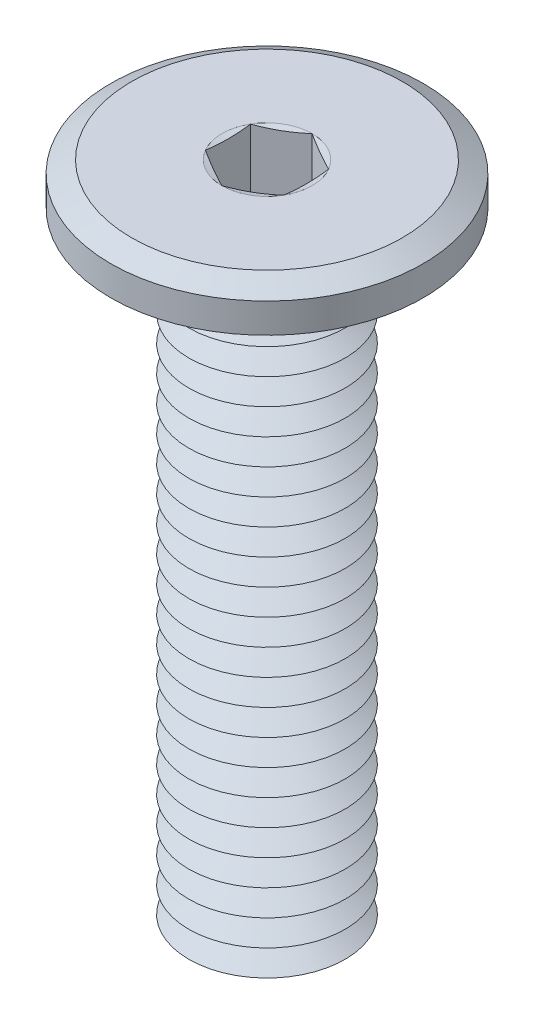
ISO-10303-21;
HEADER;
FILE_DESCRIPTION(('STEP AP214'),'2;1');
FILE_NAME('part.step','',(''),(''),'','','');
FILE_SCHEMA(('AUTOMOTIVE_DESIGN { 1 0 10303 214 1 1 1 1 }'));
ENDSEC;
DATA;
#1=APPLICATION_CONTEXT('core data for automotive mechanical design processes');
#2=APPLICATION_PROTOCOL_DEFINITION('international standard','automotive_design',2000,#1);
#3=PRODUCT_CONTEXT('',#1,'mechanical');
#4=PRODUCT('Part','Part','',(#3));
#5=PRODUCT_RELATED_PRODUCT_CATEGORY('part','',(#4));
#6=PRODUCT_DEFINITION_FORMATION('','',#4);
#7=PRODUCT_DEFINITION_CONTEXT('part definition',#1,'design');
#8=PRODUCT_DEFINITION('design','',#6,#7);
#9=PRODUCT_DEFINITION_SHAPE('','',#8);
#10=(LENGTH_UNIT() NAMED_UNIT(*) SI_UNIT(.MILLI.,.METRE.));
#11=(NAMED_UNIT(*) PLANE_ANGLE_UNIT() SI_UNIT($,.RADIAN.));
#12=(NAMED_UNIT(*) SI_UNIT($,.STERADIAN.) SOLID_ANGLE_UNIT());
#13=UNCERTAINTY_MEASURE_WITH_UNIT(LENGTH_MEASURE(1.E-05),#10,'distance_accuracy_value','');
#14=(GEOMETRIC_REPRESENTATION_CONTEXT(3) GLOBAL_UNCERTAINTY_ASSIGNED_CONTEXT((#13)) GLOBAL_UNIT_ASSIGNED_CONTEXT((#10,
#11,#12)) REPRESENTATION_CONTEXT('',''));
#15=CARTESIAN_POINT('',(0.,0.,0.));
#16=DIRECTION('',(0.,0.,1.));
#17=DIRECTION('',(1.,0.,0.));
#18=AXIS2_PLACEMENT_3D('',#15,#16,#17);
#19=CARTESIAN_POINT('',(0.,-12.05,0.));
#20=DIRECTION('',(0.,-1.,0.));
#21=DIRECTION('',(0.,0.,-1.));
#22=AXIS2_PLACEMENT_3D('',#19,#20,#21);
#23=CONICAL_SURFACE('',#22,1.5,1.0471975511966);
#24=CARTESIAN_POINT('',(0.,-11.8,0.));
#25=DIRECTION('',(0.,1.,0.));
#26=DIRECTION('',(0.,0.,1.));
#27=AXIS2_PLACEMENT_3D('',#24,#25,#26);
#28=CIRCLE('',#27,1.06698729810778);
#29=CARTESIAN_POINT('',(0.,-11.8,1.06698729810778));
#30=VERTEX_POINT('',#29);
#31=EDGE_CURVE('E540',#30,#30,#28,.T.);
#32=ORIENTED_EDGE('',*,*,#31,.F.);
#33=EDGE_LOOP('',(#32));
#34=FACE_BOUND('',#33,.T.);
#35=CARTESIAN_POINT('',(0.,-12.05,0.));
#36=DIRECTION('',(0.,1.,0.));
#37=DIRECTION('',(0.,0.,1.));
#38=AXIS2_PLACEMENT_3D('',#35,#36,#37);
#39=CIRCLE('',#38,1.5);
#40=CARTESIAN_POINT('',(0.,-12.05,1.5));
#41=VERTEX_POINT('',#40);
#42=EDGE_CURVE('E544',#41,#41,#39,.T.);
#43=ORIENTED_EDGE('',*,*,#42,.T.);
#44=EDGE_LOOP('',(#43));
#45=FACE_BOUND('',#44,.T.);
#46=ADVANCED_FACE('F39',(#34,#45),#23,.T.);
#47=CARTESIAN_POINT('',(0.,-11.8,0.));
#48=DIRECTION('',(0.,1.,0.));
#49=DIRECTION('',(0.,0.,1.));
#50=AXIS2_PLACEMENT_3D('',#47,#48,#49);
#51=CONICAL_SURFACE('',#50,1.06698729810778,1.0471975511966);
#52=CARTESIAN_POINT('',(0.,-11.55,0.));
#53=DIRECTION('',(0.,1.,0.));
#54=DIRECTION('',(0.,0.,1.));
#55=AXIS2_PLACEMENT_3D('',#52,#53,#54);
#56=CIRCLE('',#55,1.5);
#57=CARTESIAN_POINT('',(0.,-11.55,1.5));
#58=VERTEX_POINT('',#57);
#59=EDGE_CURVE('E536',#58,#58,#56,.T.);
#60=ORIENTED_EDGE('',*,*,#59,.F.);
#61=EDGE_LOOP('',(#60));
#62=FACE_BOUND('',#61,.T.);
#63=ORIENTED_EDGE('',*,*,#31,.T.);
#64=EDGE_LOOP('',(#63));
#65=FACE_BOUND('',#64,.T.);
#66=ADVANCED_FACE('F233',(#62,#65),#51,.T.);
#67=CARTESIAN_POINT('',(0.,-12.8,0.));
#68=DIRECTION('',(0.,-1.,0.));
#69=DIRECTION('',(0.,0.,-1.));
#70=AXIS2_PLACEMENT_3D('',#67,#68,#69);
#71=PLANE('',#70);
#72=CARTESIAN_POINT('',(0.,-12.8,0.));
#73=DIRECTION('',(0.,1.,0.));
#74=DIRECTION('',(0.,0.,1.));
#75=AXIS2_PLACEMENT_3D('',#72,#73,#74);
#76=CIRCLE('',#75,1.06698729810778);
#77=CARTESIAN_POINT('',(0.,-12.8,1.06698729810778));
#78=VERTEX_POINT('',#77);
#79=EDGE_CURVE('E300',#78,#78,#76,.T.);
#80=ORIENTED_EDGE('',*,*,#79,.F.);
#81=EDGE_LOOP('',(#80));
#82=FACE_BOUND('',#81,.T.);
#83=ADVANCED_FACE('F239',(#82),#71,.T.);
#84=CARTESIAN_POINT('',(0.,-12.8,0.));
#85=DIRECTION('',(0.,1.,0.));
#86=DIRECTION('',(0.,0.,1.));
#87=AXIS2_PLACEMENT_3D('',#84,#85,#86);
#88=CONICAL_SURFACE('',#87,1.06698729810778,1.0471975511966);
#89=CARTESIAN_POINT('',(0.,-12.55,0.));
#90=DIRECTION('',(0.,1.,0.));
#91=DIRECTION('',(0.,0.,1.));
#92=AXIS2_PLACEMENT_3D('',#89,#90,#91);
#93=CIRCLE('',#92,1.5);
#94=CARTESIAN_POINT('',(0.,-12.55,1.5));
#95=VERTEX_POINT('',#94);
#96=EDGE_CURVE('E552',#95,#95,#93,.T.);
#97=ORIENTED_EDGE('',*,*,#96,.F.);
#98=EDGE_LOOP('',(#97));
#99=FACE_BOUND('',#98,.T.);
#100=ORIENTED_EDGE('',*,*,#79,.T.);
#101=EDGE_LOOP('',(#100));
#102=FACE_BOUND('',#101,.T.);
#103=ADVANCED_FACE('F254',(#99,#102),#88,.T.);
#104=CARTESIAN_POINT('',(0.,-12.55,0.));
#105=DIRECTION('',(0.,-1.,0.));
#106=DIRECTION('',(0.,0.,-1.));
#107=AXIS2_PLACEMENT_3D('',#104,#105,#106);
#108=CONICAL_SURFACE('',#107,1.5,1.0471975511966);
#109=CARTESIAN_POINT('',(0.,-12.3,0.));
#110=DIRECTION('',(0.,1.,0.));
#111=DIRECTION('',(0.,0.,1.));
#112=AXIS2_PLACEMENT_3D('',#109,#110,#111);
#113=CIRCLE('',#112,1.06698729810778);
#114=CARTESIAN_POINT('',(0.,-12.3,1.06698729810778));
#115=VERTEX_POINT('',#114);
#116=EDGE_CURVE('E548',#115,#115,#113,.T.);
#117=ORIENTED_EDGE('',*,*,#116,.F.);
#118=EDGE_LOOP('',(#117));
#119=FACE_BOUND('',#118,.T.);
#120=ORIENTED_EDGE('',*,*,#96,.T.);
#121=EDGE_LOOP('',(#120));
#122=FACE_BOUND('',#121,.T.);
#123=ADVANCED_FACE('F250',(#119,#122),#108,.T.);
#124=CARTESIAN_POINT('',(0.,-12.3,0.));
#125=DIRECTION('',(0.,1.,0.));
#126=DIRECTION('',(0.,0.,1.));
#127=AXIS2_PLACEMENT_3D('',#124,#125,#126);
#128=CONICAL_SURFACE('',#127,1.06698729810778,1.0471975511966);
#129=ORIENTED_EDGE('',*,*,#42,.F.);
#130=EDGE_LOOP('',(#129));
#131=FACE_BOUND('',#130,.T.);
#132=ORIENTED_EDGE('',*,*,#116,.T.);
#133=EDGE_LOOP('',(#132));
#134=FACE_BOUND('',#133,.T.);
#135=ADVANCED_FACE('F246',(#131,#134),#128,.T.);
#136=CARTESIAN_POINT('',(0.,-11.55,0.));
#137=DIRECTION('',(0.,-1.,0.));
#138=DIRECTION('',(0.,0.,-1.));
#139=AXIS2_PLACEMENT_3D('',#136,#137,#138);
#140=CONICAL_SURFACE('',#139,1.5,1.0471975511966);
#141=CARTESIAN_POINT('',(0.,-11.3,0.));
#142=DIRECTION('',(0.,1.,0.));
#143=DIRECTION('',(0.,0.,1.));
#144=AXIS2_PLACEMENT_3D('',#141,#142,#143);
#145=CIRCLE('',#144,1.06698729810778);
#146=CARTESIAN_POINT('',(0.,-11.3,1.06698729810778));
#147=VERTEX_POINT('',#146);
#148=EDGE_CURVE('E532',#147,#147,#145,.T.);
#149=ORIENTED_EDGE('',*,*,#148,.F.);
#150=EDGE_LOOP('',(#149));
#151=FACE_BOUND('',#150,.T.);
#152=ORIENTED_EDGE('',*,*,#59,.T.);
#153=EDGE_LOOP('',(#152));
#154=FACE_BOUND('',#153,.T.);
#155=ADVANCED_FACE('F249',(#151,#154),#140,.T.);
#156=CARTESIAN_POINT('',(0.,-11.3,0.));
#157=DIRECTION('',(0.,1.,0.));
#158=DIRECTION('',(0.,0.,1.));
#159=AXIS2_PLACEMENT_3D('',#156,#157,#158);
#160=CONICAL_SURFACE('',#159,1.06698729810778,1.0471975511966);
#161=CARTESIAN_POINT('',(0.,-11.05,0.));
#162=DIRECTION('',(0.,1.,0.));
#163=DIRECTION('',(0.,0.,1.));
#164=AXIS2_PLACEMENT_3D('',#161,#162,#163);
#165=CIRCLE('',#164,1.5);
#166=CARTESIAN_POINT('',(0.,-11.05,1.5));
#167=VERTEX_POINT('',#166);
#168=EDGE_CURVE('E528',#167,#167,#165,.T.);
#169=ORIENTED_EDGE('',*,*,#168,.F.);
#170=EDGE_LOOP('',(#169));
#171=FACE_BOUND('',#170,.T.);
#172=ORIENTED_EDGE('',*,*,#148,.T.);
#173=EDGE_LOOP('',(#172));
#174=FACE_BOUND('',#173,.T.);
#175=ADVANCED_FACE('F1023',(#171,#174),#160,.T.);
#176=CARTESIAN_POINT('',(0.,-11.05,0.));
#177=DIRECTION('',(0.,-1.,0.));
#178=DIRECTION('',(0.,0.,-1.));
#179=AXIS2_PLACEMENT_3D('',#176,#177,#178);
#180=CONICAL_SURFACE('',#179,1.5,1.0471975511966);
#181=CARTESIAN_POINT('',(0.,-10.8,0.));
#182=DIRECTION('',(0.,1.,0.));
#183=DIRECTION('',(0.,0.,1.));
#184=AXIS2_PLACEMENT_3D('',#181,#182,#183);
#185=CIRCLE('',#184,1.06698729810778);
#186=CARTESIAN_POINT('',(0.,-10.8,1.06698729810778));
#187=VERTEX_POINT('',#186);
#188=EDGE_CURVE('E524',#187,#187,#185,.T.);
#189=ORIENTED_EDGE('',*,*,#188,.F.);
#190=EDGE_LOOP('',(#189));
#191=FACE_BOUND('',#190,.T.);
#192=ORIENTED_EDGE('',*,*,#168,.T.);
#193=EDGE_LOOP('',(#192));
#194=FACE_BOUND('',#193,.T.);
#195=ADVANCED_FACE('F1014',(#191,#194),#180,.T.);
#196=CARTESIAN_POINT('',(0.,-10.8,0.));
#197=DIRECTION('',(0.,1.,0.));
#198=DIRECTION('',(0.,0.,1.));
#199=AXIS2_PLACEMENT_3D('',#196,#197,#198);
#200=CONICAL_SURFACE('',#199,1.06698729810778,1.0471975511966);
#201=CARTESIAN_POINT('',(0.,-10.55,0.));
#202=DIRECTION('',(0.,1.,0.));
#203=DIRECTION('',(0.,0.,1.));
#204=AXIS2_PLACEMENT_3D('',#201,#202,#203);
#205=CIRCLE('',#204,1.5);
#206=CARTESIAN_POINT('',(0.,-10.55,1.5));
#207=VERTEX_POINT('',#206);
#208=EDGE_CURVE('E520',#207,#207,#205,.T.);
#209=ORIENTED_EDGE('',*,*,#208,.F.);
#210=EDGE_LOOP('',(#209));
#211=FACE_BOUND('',#210,.T.);
#212=ORIENTED_EDGE('',*,*,#188,.T.);
#213=EDGE_LOOP('',(#212));
#214=FACE_BOUND('',#213,.T.);
#215=ADVANCED_FACE('F1005',(#211,#214),#200,.T.);
#216=CARTESIAN_POINT('',(0.,-10.55,0.));
#217=DIRECTION('',(0.,-1.,0.));
#218=DIRECTION('',(0.,0.,-1.));
#219=AXIS2_PLACEMENT_3D('',#216,#217,#218);
#220=CONICAL_SURFACE('',#219,1.5,1.0471975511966);
#221=CARTESIAN_POINT('',(0.,-10.3,0.));
#222=DIRECTION('',(0.,1.,0.));
#223=DIRECTION('',(0.,0.,1.));
#224=AXIS2_PLACEMENT_3D('',#221,#222,#223);
#225=CIRCLE('',#224,1.06698729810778);
#226=CARTESIAN_POINT('',(0.,-10.3,1.06698729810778));
#227=VERTEX_POINT('',#226);
#228=EDGE_CURVE('E516',#227,#227,#225,.T.);
#229=ORIENTED_EDGE('',*,*,#228,.F.);
#230=EDGE_LOOP('',(#229));
#231=FACE_BOUND('',#230,.T.);
#232=ORIENTED_EDGE('',*,*,#208,.T.);
#233=EDGE_LOOP('',(#232));
#234=FACE_BOUND('',#233,.T.);
#235=ADVANCED_FACE('F996',(#231,#234),#220,.T.);
#236=CARTESIAN_POINT('',(0.,-10.3,0.));
#237=DIRECTION('',(0.,1.,0.));
#238=DIRECTION('',(0.,0.,1.));
#239=AXIS2_PLACEMENT_3D('',#236,#237,#238);
#240=CONICAL_SURFACE('',#239,1.06698729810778,1.0471975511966);
#241=CARTESIAN_POINT('',(0.,-10.05,0.));
#242=DIRECTION('',(0.,1.,0.));
#243=DIRECTION('',(0.,0.,1.));
#244=AXIS2_PLACEMENT_3D('',#241,#242,#243);
#245=CIRCLE('',#244,1.5);
#246=CARTESIAN_POINT('',(0.,-10.05,1.5));
#247=VERTEX_POINT('',#246);
#248=EDGE_CURVE('E512',#247,#247,#245,.T.);
#249=ORIENTED_EDGE('',*,*,#248,.F.);
#250=EDGE_LOOP('',(#249));
#251=FACE_BOUND('',#250,.T.);
#252=ORIENTED_EDGE('',*,*,#228,.T.);
#253=EDGE_LOOP('',(#252));
#254=FACE_BOUND('',#253,.T.);
#255=ADVANCED_FACE('F987',(#251,#254),#240,.T.);
#256=CARTESIAN_POINT('',(0.,-10.05,0.));
#257=DIRECTION('',(0.,-1.,0.));
#258=DIRECTION('',(0.,0.,-1.));
#259=AXIS2_PLACEMENT_3D('',#256,#257,#258);
#260=CONICAL_SURFACE('',#259,1.5,1.0471975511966);
#261=CARTESIAN_POINT('',(0.,-9.8,0.));
#262=DIRECTION('',(0.,1.,0.));
#263=DIRECTION('',(0.,0.,1.));
#264=AXIS2_PLACEMENT_3D('',#261,#262,#263);
#265=CIRCLE('',#264,1.06698729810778);
#266=CARTESIAN_POINT('',(0.,-9.8,1.06698729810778));
#267=VERTEX_POINT('',#266);
#268=EDGE_CURVE('E508',#267,#267,#265,.T.);
#269=ORIENTED_EDGE('',*,*,#268,.F.);
#270=EDGE_LOOP('',(#269));
#271=FACE_BOUND('',#270,.T.);
#272=ORIENTED_EDGE('',*,*,#248,.T.);
#273=EDGE_LOOP('',(#272));
#274=FACE_BOUND('',#273,.T.);
#275=ADVANCED_FACE('F978',(#271,#274),#260,.T.);
#276=CARTESIAN_POINT('',(0.,-9.8,0.));
#277=DIRECTION('',(0.,1.,0.));
#278=DIRECTION('',(0.,0.,1.));
#279=AXIS2_PLACEMENT_3D('',#276,#277,#278);
#280=CONICAL_SURFACE('',#279,1.06698729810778,1.0471975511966);
#281=CARTESIAN_POINT('',(0.,-9.55,0.));
#282=DIRECTION('',(0.,1.,0.));
#283=DIRECTION('',(0.,0.,1.));
#284=AXIS2_PLACEMENT_3D('',#281,#282,#283);
#285=CIRCLE('',#284,1.5);
#286=CARTESIAN_POINT('',(0.,-9.55,1.5));
#287=VERTEX_POINT('',#286);
#288=EDGE_CURVE('E504',#287,#287,#285,.T.);
#289=ORIENTED_EDGE('',*,*,#288,.F.);
#290=EDGE_LOOP('',(#289));
#291=FACE_BOUND('',#290,.T.);
#292=ORIENTED_EDGE('',*,*,#268,.T.);
#293=EDGE_LOOP('',(#292));
#294=FACE_BOUND('',#293,.T.);
#295=ADVANCED_FACE('F969',(#291,#294),#280,.T.);
#296=CARTESIAN_POINT('',(0.,-9.55,0.));
#297=DIRECTION('',(0.,-1.,0.));
#298=DIRECTION('',(0.,0.,-1.));
#299=AXIS2_PLACEMENT_3D('',#296,#297,#298);
#300=CONICAL_SURFACE('',#299,1.5,1.0471975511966);
#301=CARTESIAN_POINT('',(0.,-9.3,0.));
#302=DIRECTION('',(0.,1.,0.));
#303=DIRECTION('',(0.,0.,1.));
#304=AXIS2_PLACEMENT_3D('',#301,#302,#303);
#305=CIRCLE('',#304,1.06698729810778);
#306=CARTESIAN_POINT('',(0.,-9.3,1.06698729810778));
#307=VERTEX_POINT('',#306);
#308=EDGE_CURVE('E500',#307,#307,#305,.T.);
#309=ORIENTED_EDGE('',*,*,#308,.F.);
#310=EDGE_LOOP('',(#309));
#311=FACE_BOUND('',#310,.T.);
#312=ORIENTED_EDGE('',*,*,#288,.T.);
#313=EDGE_LOOP('',(#312));
#314=FACE_BOUND('',#313,.T.);
#315=ADVANCED_FACE('F960',(#311,#314),#300,.T.);
#316=CARTESIAN_POINT('',(0.,-9.3,0.));
#317=DIRECTION('',(0.,1.,0.));
#318=DIRECTION('',(0.,0.,1.));
#319=AXIS2_PLACEMENT_3D('',#316,#317,#318);
#320=CONICAL_SURFACE('',#319,1.06698729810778,1.0471975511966);
#321=CARTESIAN_POINT('',(0.,-9.05,0.));
#322=DIRECTION('',(0.,1.,0.));
#323=DIRECTION('',(0.,0.,1.));
#324=AXIS2_PLACEMENT_3D('',#321,#322,#323);
#325=CIRCLE('',#324,1.5);
#326=CARTESIAN_POINT('',(0.,-9.05,1.5));
#327=VERTEX_POINT('',#326);
#328=EDGE_CURVE('E497',#327,#327,#325,.T.);
#329=ORIENTED_EDGE('',*,*,#328,.F.);
#330=EDGE_LOOP('',(#329));
#331=FACE_BOUND('',#330,.T.);
#332=ORIENTED_EDGE('',*,*,#308,.T.);
#333=EDGE_LOOP('',(#332));
#334=FACE_BOUND('',#333,.T.);
#335=ADVANCED_FACE('F951',(#331,#334),#320,.T.);
#336=CARTESIAN_POINT('',(0.,-9.05,0.));
#337=DIRECTION('',(0.,-1.,0.));
#338=DIRECTION('',(0.,0.,-1.));
#339=AXIS2_PLACEMENT_3D('',#336,#337,#338);
#340=CONICAL_SURFACE('',#339,1.5,1.0471975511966);
#341=CARTESIAN_POINT('',(0.,-8.8,0.));
#342=DIRECTION('',(0.,1.,0.));
#343=DIRECTION('',(0.,0.,1.));
#344=AXIS2_PLACEMENT_3D('',#341,#342,#343);
#345=CIRCLE('',#344,1.06698729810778);
#346=CARTESIAN_POINT('',(0.,-8.8,1.06698729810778));
#347=VERTEX_POINT('',#346);
#348=EDGE_CURVE('E493',#347,#347,#345,.T.);
#349=ORIENTED_EDGE('',*,*,#348,.F.);
#350=EDGE_LOOP('',(#349));
#351=FACE_BOUND('',#350,.T.);
#352=ORIENTED_EDGE('',*,*,#328,.T.);
#353=EDGE_LOOP('',(#352));
#354=FACE_BOUND('',#353,.T.);
#355=ADVANCED_FACE('F942',(#351,#354),#340,.T.);
#356=CARTESIAN_POINT('',(0.,-8.8,0.));
#357=DIRECTION('',(0.,1.,0.));
#358=DIRECTION('',(0.,0.,1.));
#359=AXIS2_PLACEMENT_3D('',#356,#357,#358);
#360=CONICAL_SURFACE('',#359,1.06698729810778,1.0471975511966);
#361=CARTESIAN_POINT('',(0.,-8.55,0.));
#362=DIRECTION('',(0.,1.,0.));
#363=DIRECTION('',(0.,0.,1.));
#364=AXIS2_PLACEMENT_3D('',#361,#362,#363);
#365=CIRCLE('',#364,1.5);
#366=CARTESIAN_POINT('',(0.,-8.55,1.5));
#367=VERTEX_POINT('',#366);
#368=EDGE_CURVE('E489',#367,#367,#365,.T.);
#369=ORIENTED_EDGE('',*,*,#368,.F.);
#370=EDGE_LOOP('',(#369));
#371=FACE_BOUND('',#370,.T.);
#372=ORIENTED_EDGE('',*,*,#348,.T.);
#373=EDGE_LOOP('',(#372));
#374=FACE_BOUND('',#373,.T.);
#375=ADVANCED_FACE('F933',(#371,#374),#360,.T.);
#376=CARTESIAN_POINT('',(0.,-8.55,0.));
#377=DIRECTION('',(0.,-1.,0.));
#378=DIRECTION('',(0.,0.,-1.));
#379=AXIS2_PLACEMENT_3D('',#376,#377,#378);
#380=CONICAL_SURFACE('',#379,1.5,1.0471975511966);
#381=CARTESIAN_POINT('',(0.,-8.3,0.));
#382=DIRECTION('',(0.,1.,0.));
#383=DIRECTION('',(0.,0.,1.));
#384=AXIS2_PLACEMENT_3D('',#381,#382,#383);
#385=CIRCLE('',#384,1.06698729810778);
#386=CARTESIAN_POINT('',(0.,-8.3,1.06698729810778));
#387=VERTEX_POINT('',#386);
#388=EDGE_CURVE('E485',#387,#387,#385,.T.);
#389=ORIENTED_EDGE('',*,*,#388,.F.);
#390=EDGE_LOOP('',(#389));
#391=FACE_BOUND('',#390,.T.);
#392=ORIENTED_EDGE('',*,*,#368,.T.);
#393=EDGE_LOOP('',(#392));
#394=FACE_BOUND('',#393,.T.);
#395=ADVANCED_FACE('F924',(#391,#394),#380,.T.);
#396=CARTESIAN_POINT('',(0.,-8.3,0.));
#397=DIRECTION('',(0.,1.,0.));
#398=DIRECTION('',(0.,0.,1.));
#399=AXIS2_PLACEMENT_3D('',#396,#397,#398);
#400=CONICAL_SURFACE('',#399,1.06698729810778,1.0471975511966);
#401=CARTESIAN_POINT('',(0.,-8.05,0.));
#402=DIRECTION('',(0.,1.,0.));
#403=DIRECTION('',(0.,0.,1.));
#404=AXIS2_PLACEMENT_3D('',#401,#402,#403);
#405=CIRCLE('',#404,1.5);
#406=CARTESIAN_POINT('',(0.,-8.05,1.5));
#407=VERTEX_POINT('',#406);
#408=EDGE_CURVE('E481',#407,#407,#405,.T.);
#409=ORIENTED_EDGE('',*,*,#408,.F.);
#410=EDGE_LOOP('',(#409));
#411=FACE_BOUND('',#410,.T.);
#412=ORIENTED_EDGE('',*,*,#388,.T.);
#413=EDGE_LOOP('',(#412));
#414=FACE_BOUND('',#413,.T.);
#415=ADVANCED_FACE('F915',(#411,#414),#400,.T.);
#416=CARTESIAN_POINT('',(0.,-8.05,0.));
#417=DIRECTION('',(0.,-1.,0.));
#418=DIRECTION('',(0.,0.,-1.));
#419=AXIS2_PLACEMENT_3D('',#416,#417,#418);
#420=CONICAL_SURFACE('',#419,1.5,1.0471975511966);
#421=CARTESIAN_POINT('',(0.,-7.8,0.));
#422=DIRECTION('',(0.,1.,0.));
#423=DIRECTION('',(0.,0.,1.));
#424=AXIS2_PLACEMENT_3D('',#421,#422,#423);
#425=CIRCLE('',#424,1.06698729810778);
#426=CARTESIAN_POINT('',(0.,-7.8,1.06698729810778));
#427=VERTEX_POINT('',#426);
#428=EDGE_CURVE('E477',#427,#427,#425,.T.);
#429=ORIENTED_EDGE('',*,*,#428,.F.);
#430=EDGE_LOOP('',(#429));
#431=FACE_BOUND('',#430,.T.);
#432=ORIENTED_EDGE('',*,*,#408,.T.);
#433=EDGE_LOOP('',(#432));
#434=FACE_BOUND('',#433,.T.);
#435=ADVANCED_FACE('F906',(#431,#434),#420,.T.);
#436=CARTESIAN_POINT('',(0.,-7.8,0.));
#437=DIRECTION('',(0.,1.,0.));
#438=DIRECTION('',(0.,0.,1.));
#439=AXIS2_PLACEMENT_3D('',#436,#437,#438);
#440=CONICAL_SURFACE('',#439,1.06698729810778,1.0471975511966);
#441=CARTESIAN_POINT('',(0.,-7.55,0.));
#442=DIRECTION('',(0.,1.,0.));
#443=DIRECTION('',(0.,0.,1.));
#444=AXIS2_PLACEMENT_3D('',#441,#442,#443);
#445=CIRCLE('',#444,1.5);
#446=CARTESIAN_POINT('',(0.,-7.55,1.5));
#447=VERTEX_POINT('',#446);
#448=EDGE_CURVE('E473',#447,#447,#445,.T.);
#449=ORIENTED_EDGE('',*,*,#448,.F.);
#450=EDGE_LOOP('',(#449));
#451=FACE_BOUND('',#450,.T.);
#452=ORIENTED_EDGE('',*,*,#428,.T.);
#453=EDGE_LOOP('',(#452));
#454=FACE_BOUND('',#453,.T.);
#455=ADVANCED_FACE('F897',(#451,#454),#440,.T.);
#456=CARTESIAN_POINT('',(0.,-7.55,0.));
#457=DIRECTION('',(0.,-1.,0.));
#458=DIRECTION('',(0.,0.,-1.));
#459=AXIS2_PLACEMENT_3D('',#456,#457,#458);
#460=CONICAL_SURFACE('',#459,1.5,1.0471975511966);
#461=CARTESIAN_POINT('',(0.,-7.3,0.));
#462=DIRECTION('',(0.,1.,0.));
#463=DIRECTION('',(0.,0.,1.));
#464=AXIS2_PLACEMENT_3D('',#461,#462,#463);
#465=CIRCLE('',#464,1.06698729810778);
#466=CARTESIAN_POINT('',(0.,-7.3,1.06698729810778));
#467=VERTEX_POINT('',#466);
#468=EDGE_CURVE('E469',#467,#467,#465,.T.);
#469=ORIENTED_EDGE('',*,*,#468,.F.);
#470=EDGE_LOOP('',(#469));
#471=FACE_BOUND('',#470,.T.);
#472=ORIENTED_EDGE('',*,*,#448,.T.);
#473=EDGE_LOOP('',(#472));
#474=FACE_BOUND('',#473,.T.);
#475=ADVANCED_FACE('F888',(#471,#474),#460,.T.);
#476=CARTESIAN_POINT('',(0.,-7.3,0.));
#477=DIRECTION('',(0.,1.,0.));
#478=DIRECTION('',(0.,0.,1.));
#479=AXIS2_PLACEMENT_3D('',#476,#477,#478);
#480=CONICAL_SURFACE('',#479,1.06698729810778,1.0471975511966);
#481=CARTESIAN_POINT('',(0.,-7.05,0.));
#482=DIRECTION('',(0.,1.,0.));
#483=DIRECTION('',(0.,0.,1.));
#484=AXIS2_PLACEMENT_3D('',#481,#482,#483);
#485=CIRCLE('',#484,1.5);
#486=CARTESIAN_POINT('',(0.,-7.05,1.5));
#487=VERTEX_POINT('',#486);
#488=EDGE_CURVE('E465',#487,#487,#485,.T.);
#489=ORIENTED_EDGE('',*,*,#488,.F.);
#490=EDGE_LOOP('',(#489));
#491=FACE_BOUND('',#490,.T.);
#492=ORIENTED_EDGE('',*,*,#468,.T.);
#493=EDGE_LOOP('',(#492));
#494=FACE_BOUND('',#493,.T.);
#495=ADVANCED_FACE('F879',(#491,#494),#480,.T.);
#496=CARTESIAN_POINT('',(0.,-7.05,0.));
#497=DIRECTION('',(0.,-1.,0.));
#498=DIRECTION('',(0.,0.,-1.));
#499=AXIS2_PLACEMENT_3D('',#496,#497,#498);
#500=CONICAL_SURFACE('',#499,1.5,1.0471975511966);
#501=CARTESIAN_POINT('',(0.,-6.8,0.));
#502=DIRECTION('',(0.,1.,0.));
#503=DIRECTION('',(0.,0.,1.));
#504=AXIS2_PLACEMENT_3D('',#501,#502,#503);
#505=CIRCLE('',#504,1.06698729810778);
#506=CARTESIAN_POINT('',(0.,-6.8,1.06698729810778));
#507=VERTEX_POINT('',#506);
#508=EDGE_CURVE('E461',#507,#507,#505,.T.);
#509=ORIENTED_EDGE('',*,*,#508,.F.);
#510=EDGE_LOOP('',(#509));
#511=FACE_BOUND('',#510,.T.);
#512=ORIENTED_EDGE('',*,*,#488,.T.);
#513=EDGE_LOOP('',(#512));
#514=FACE_BOUND('',#513,.T.);
#515=ADVANCED_FACE('F870',(#511,#514),#500,.T.);
#516=CARTESIAN_POINT('',(0.,-6.8,0.));
#517=DIRECTION('',(0.,1.,0.));
#518=DIRECTION('',(0.,0.,1.));
#519=AXIS2_PLACEMENT_3D('',#516,#517,#518);
#520=CONICAL_SURFACE('',#519,1.06698729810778,1.0471975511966);
#521=CARTESIAN_POINT('',(0.,-6.55,0.));
#522=DIRECTION('',(0.,1.,0.));
#523=DIRECTION('',(0.,0.,1.));
#524=AXIS2_PLACEMENT_3D('',#521,#522,#523);
#525=CIRCLE('',#524,1.5);
#526=CARTESIAN_POINT('',(0.,-6.55,1.5));
#527=VERTEX_POINT('',#526);
#528=EDGE_CURVE('E457',#527,#527,#525,.T.);
#529=ORIENTED_EDGE('',*,*,#528,.F.);
#530=EDGE_LOOP('',(#529));
#531=FACE_BOUND('',#530,.T.);
#532=ORIENTED_EDGE('',*,*,#508,.T.);
#533=EDGE_LOOP('',(#532));
#534=FACE_BOUND('',#533,.T.);
#535=ADVANCED_FACE('F861',(#531,#534),#520,.T.);
#536=CARTESIAN_POINT('',(0.,-6.55,0.));
#537=DIRECTION('',(0.,-1.,0.));
#538=DIRECTION('',(0.,0.,-1.));
#539=AXIS2_PLACEMENT_3D('',#536,#537,#538);
#540=CONICAL_SURFACE('',#539,1.5,1.0471975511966);
#541=CARTESIAN_POINT('',(0.,-6.3,0.));
#542=DIRECTION('',(0.,1.,0.));
#543=DIRECTION('',(0.,0.,1.));
#544=AXIS2_PLACEMENT_3D('',#541,#542,#543);
#545=CIRCLE('',#544,1.06698729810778);
#546=CARTESIAN_POINT('',(0.,-6.3,1.06698729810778));
#547=VERTEX_POINT('',#546);
#548=EDGE_CURVE('E453',#547,#547,#545,.T.);
#549=ORIENTED_EDGE('',*,*,#548,.F.);
#550=EDGE_LOOP('',(#549));
#551=FACE_BOUND('',#550,.T.);
#552=ORIENTED_EDGE('',*,*,#528,.T.);
#553=EDGE_LOOP('',(#552));
#554=FACE_BOUND('',#553,.T.);
#555=ADVANCED_FACE('F852',(#551,#554),#540,.T.);
#556=CARTESIAN_POINT('',(0.,-6.3,0.));
#557=DIRECTION('',(0.,1.,0.));
#558=DIRECTION('',(0.,0.,1.));
#559=AXIS2_PLACEMENT_3D('',#556,#557,#558);
#560=CONICAL_SURFACE('',#559,1.06698729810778,1.0471975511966);
#561=CARTESIAN_POINT('',(0.,-6.05,0.));
#562=DIRECTION('',(0.,1.,0.));
#563=DIRECTION('',(0.,0.,1.));
#564=AXIS2_PLACEMENT_3D('',#561,#562,#563);
#565=CIRCLE('',#564,1.5);
#566=CARTESIAN_POINT('',(0.,-6.05,1.5));
#567=VERTEX_POINT('',#566);
#568=EDGE_CURVE('E449',#567,#567,#565,.T.);
#569=ORIENTED_EDGE('',*,*,#568,.F.);
#570=EDGE_LOOP('',(#569));
#571=FACE_BOUND('',#570,.T.);
#572=ORIENTED_EDGE('',*,*,#548,.T.);
#573=EDGE_LOOP('',(#572));
#574=FACE_BOUND('',#573,.T.);
#575=ADVANCED_FACE('F843',(#571,#574),#560,.T.);
#576=CARTESIAN_POINT('',(0.,-6.05,0.));
#577=DIRECTION('',(0.,-1.,0.));
#578=DIRECTION('',(0.,0.,-1.));
#579=AXIS2_PLACEMENT_3D('',#576,#577,#578);
#580=CONICAL_SURFACE('',#579,1.5,1.0471975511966);
#581=CARTESIAN_POINT('',(0.,-5.8,0.));
#582=DIRECTION('',(0.,1.,0.));
#583=DIRECTION('',(0.,0.,1.));
#584=AXIS2_PLACEMENT_3D('',#581,#582,#583);
#585=CIRCLE('',#584,1.06698729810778);
#586=CARTESIAN_POINT('',(0.,-5.8,1.06698729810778));
#587=VERTEX_POINT('',#586);
#588=EDGE_CURVE('E445',#587,#587,#585,.T.);
#589=ORIENTED_EDGE('',*,*,#588,.F.);
#590=EDGE_LOOP('',(#589));
#591=FACE_BOUND('',#590,.T.);
#592=ORIENTED_EDGE('',*,*,#568,.T.);
#593=EDGE_LOOP('',(#592));
#594=FACE_BOUND('',#593,.T.);
#595=ADVANCED_FACE('F834',(#591,#594),#580,.T.);
#596=CARTESIAN_POINT('',(0.,-5.8,0.));
#597=DIRECTION('',(0.,1.,0.));
#598=DIRECTION('',(0.,0.,1.));
#599=AXIS2_PLACEMENT_3D('',#596,#597,#598);
#600=CONICAL_SURFACE('',#599,1.06698729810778,1.0471975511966);
#601=CARTESIAN_POINT('',(0.,-5.55,0.));
#602=DIRECTION('',(0.,1.,0.));
#603=DIRECTION('',(0.,0.,1.));
#604=AXIS2_PLACEMENT_3D('',#601,#602,#603);
#605=CIRCLE('',#604,1.5);
#606=CARTESIAN_POINT('',(0.,-5.55,1.5));
#607=VERTEX_POINT('',#606);
#608=EDGE_CURVE('E442',#607,#607,#605,.T.);
#609=ORIENTED_EDGE('',*,*,#608,.F.);
#610=EDGE_LOOP('',(#609));
#611=FACE_BOUND('',#610,.T.);
#612=ORIENTED_EDGE('',*,*,#588,.T.);
#613=EDGE_LOOP('',(#612));
#614=FACE_BOUND('',#613,.T.);
#615=ADVANCED_FACE('F825',(#611,#614),#600,.T.);
#616=CARTESIAN_POINT('',(0.,-5.55,0.));
#617=DIRECTION('',(0.,-1.,0.));
#618=DIRECTION('',(0.,0.,-1.));
#619=AXIS2_PLACEMENT_3D('',#616,#617,#618);
#620=CONICAL_SURFACE('',#619,1.5,1.0471975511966);
#621=CARTESIAN_POINT('',(0.,-5.3,0.));
#622=DIRECTION('',(0.,1.,0.));
#623=DIRECTION('',(0.,0.,1.));
#624=AXIS2_PLACEMENT_3D('',#621,#622,#623);
#625=CIRCLE('',#624,1.06698729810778);
#626=CARTESIAN_POINT('',(0.,-5.3,1.06698729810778));
#627=VERTEX_POINT('',#626);
#628=EDGE_CURVE('E438',#627,#627,#625,.T.);
#629=ORIENTED_EDGE('',*,*,#628,.F.);
#630=EDGE_LOOP('',(#629));
#631=FACE_BOUND('',#630,.T.);
#632=ORIENTED_EDGE('',*,*,#608,.T.);
#633=EDGE_LOOP('',(#632));
#634=FACE_BOUND('',#633,.T.);
#635=ADVANCED_FACE('F816',(#631,#634),#620,.T.);
#636=CARTESIAN_POINT('',(0.,-5.3,0.));
#637=DIRECTION('',(0.,1.,0.));
#638=DIRECTION('',(0.,0.,1.));
#639=AXIS2_PLACEMENT_3D('',#636,#637,#638);
#640=CONICAL_SURFACE('',#639,1.06698729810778,1.0471975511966);
#641=CARTESIAN_POINT('',(0.,-5.05,0.));
#642=DIRECTION('',(0.,1.,0.));
#643=DIRECTION('',(0.,0.,1.));
#644=AXIS2_PLACEMENT_3D('',#641,#642,#643);
#645=CIRCLE('',#644,1.5);
#646=CARTESIAN_POINT('',(0.,-5.05,1.5));
#647=VERTEX_POINT('',#646);
#648=EDGE_CURVE('E434',#647,#647,#645,.T.);
#649=ORIENTED_EDGE('',*,*,#648,.F.);
#650=EDGE_LOOP('',(#649));
#651=FACE_BOUND('',#650,.T.);
#652=ORIENTED_EDGE('',*,*,#628,.T.);
#653=EDGE_LOOP('',(#652));
#654=FACE_BOUND('',#653,.T.);
#655=ADVANCED_FACE('F807',(#651,#654),#640,.T.);
#656=CARTESIAN_POINT('',(0.,-5.05,0.));
#657=DIRECTION('',(0.,-1.,0.));
#658=DIRECTION('',(0.,0.,-1.));
#659=AXIS2_PLACEMENT_3D('',#656,#657,#658);
#660=CONICAL_SURFACE('',#659,1.5,1.0471975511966);
#661=CARTESIAN_POINT('',(0.,-4.8,0.));
#662=DIRECTION('',(0.,1.,0.));
#663=DIRECTION('',(0.,0.,1.));
#664=AXIS2_PLACEMENT_3D('',#661,#662,#663);
#665=CIRCLE('',#664,1.06698729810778);
#666=CARTESIAN_POINT('',(0.,-4.8,1.06698729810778));
#667=VERTEX_POINT('',#666);
#668=EDGE_CURVE('E430',#667,#667,#665,.T.);
#669=ORIENTED_EDGE('',*,*,#668,.F.);
#670=EDGE_LOOP('',(#669));
#671=FACE_BOUND('',#670,.T.);
#672=ORIENTED_EDGE('',*,*,#648,.T.);
#673=EDGE_LOOP('',(#672));
#674=FACE_BOUND('',#673,.T.);
#675=ADVANCED_FACE('F798',(#671,#674),#660,.T.);
#676=CARTESIAN_POINT('',(0.,-4.8,0.));
#677=DIRECTION('',(0.,1.,0.));
#678=DIRECTION('',(0.,0.,1.));
#679=AXIS2_PLACEMENT_3D('',#676,#677,#678);
#680=CONICAL_SURFACE('',#679,1.06698729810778,1.0471975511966);
#681=CARTESIAN_POINT('',(0.,-4.55,0.));
#682=DIRECTION('',(0.,1.,0.));
#683=DIRECTION('',(0.,0.,1.));
#684=AXIS2_PLACEMENT_3D('',#681,#682,#683);
#685=CIRCLE('',#684,1.5);
#686=CARTESIAN_POINT('',(0.,-4.55,1.5));
#687=VERTEX_POINT('',#686);
#688=EDGE_CURVE('E427',#687,#687,#685,.T.);
#689=ORIENTED_EDGE('',*,*,#688,.F.);
#690=EDGE_LOOP('',(#689));
#691=FACE_BOUND('',#690,.T.);
#692=ORIENTED_EDGE('',*,*,#668,.T.);
#693=EDGE_LOOP('',(#692));
#694=FACE_BOUND('',#693,.T.);
#695=ADVANCED_FACE('F789',(#691,#694),#680,.T.);
#696=CARTESIAN_POINT('',(0.,-4.55,0.));
#697=DIRECTION('',(0.,-1.,0.));
#698=DIRECTION('',(0.,0.,-1.));
#699=AXIS2_PLACEMENT_3D('',#696,#697,#698);
#700=CONICAL_SURFACE('',#699,1.5,1.0471975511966);
#701=CARTESIAN_POINT('',(0.,-4.3,0.));
#702=DIRECTION('',(0.,1.,0.));
#703=DIRECTION('',(0.,0.,1.));
#704=AXIS2_PLACEMENT_3D('',#701,#702,#703);
#705=CIRCLE('',#704,1.06698729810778);
#706=CARTESIAN_POINT('',(0.,-4.3,1.06698729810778));
#707=VERTEX_POINT('',#706);
#708=EDGE_CURVE('E423',#707,#707,#705,.T.);
#709=ORIENTED_EDGE('',*,*,#708,.F.);
#710=EDGE_LOOP('',(#709));
#711=FACE_BOUND('',#710,.T.);
#712=ORIENTED_EDGE('',*,*,#688,.T.);
#713=EDGE_LOOP('',(#712));
#714=FACE_BOUND('',#713,.T.);
#715=ADVANCED_FACE('F780',(#711,#714),#700,.T.);
#716=CARTESIAN_POINT('',(0.,-4.3,0.));
#717=DIRECTION('',(0.,1.,0.));
#718=DIRECTION('',(0.,0.,1.));
#719=AXIS2_PLACEMENT_3D('',#716,#717,#718);
#720=CONICAL_SURFACE('',#719,1.06698729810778,1.0471975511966);
#721=CARTESIAN_POINT('',(0.,-4.05,0.));
#722=DIRECTION('',(0.,1.,0.));
#723=DIRECTION('',(0.,0.,1.));
#724=AXIS2_PLACEMENT_3D('',#721,#722,#723);
#725=CIRCLE('',#724,1.5);
#726=CARTESIAN_POINT('',(0.,-4.05,1.5));
#727=VERTEX_POINT('',#726);
#728=EDGE_CURVE('E419',#727,#727,#725,.T.);
#729=ORIENTED_EDGE('',*,*,#728,.F.);
#730=EDGE_LOOP('',(#729));
#731=FACE_BOUND('',#730,.T.);
#732=ORIENTED_EDGE('',*,*,#708,.T.);
#733=EDGE_LOOP('',(#732));
#734=FACE_BOUND('',#733,.T.);
#735=ADVANCED_FACE('F771',(#731,#734),#720,.T.);
#736=CARTESIAN_POINT('',(0.,-4.05,0.));
#737=DIRECTION('',(0.,-1.,0.));
#738=DIRECTION('',(0.,0.,-1.));
#739=AXIS2_PLACEMENT_3D('',#736,#737,#738);
#740=CONICAL_SURFACE('',#739,1.5,1.0471975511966);
#741=CARTESIAN_POINT('',(0.,-3.8,0.));
#742=DIRECTION('',(0.,1.,0.));
#743=DIRECTION('',(0.,0.,1.));
#744=AXIS2_PLACEMENT_3D('',#741,#742,#743);
#745=CIRCLE('',#744,1.06698729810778);
#746=CARTESIAN_POINT('',(0.,-3.8,1.06698729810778));
#747=VERTEX_POINT('',#746);
#748=EDGE_CURVE('E415',#747,#747,#745,.T.);
#749=ORIENTED_EDGE('',*,*,#748,.F.);
#750=EDGE_LOOP('',(#749));
#751=FACE_BOUND('',#750,.T.);
#752=ORIENTED_EDGE('',*,*,#728,.T.);
#753=EDGE_LOOP('',(#752));
#754=FACE_BOUND('',#753,.T.);
#755=ADVANCED_FACE('F762',(#751,#754),#740,.T.);
#756=CARTESIAN_POINT('',(0.,-3.8,0.));
#757=DIRECTION('',(0.,1.,0.));
#758=DIRECTION('',(0.,0.,1.));
#759=AXIS2_PLACEMENT_3D('',#756,#757,#758);
#760=CONICAL_SURFACE('',#759,1.06698729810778,1.0471975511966);
#761=CARTESIAN_POINT('',(0.,-3.55,0.));
#762=DIRECTION('',(0.,1.,0.));
#763=DIRECTION('',(0.,0.,1.));
#764=AXIS2_PLACEMENT_3D('',#761,#762,#763);
#765=CIRCLE('',#764,1.5);
#766=CARTESIAN_POINT('',(0.,-3.55,1.5));
#767=VERTEX_POINT('',#766);
#768=EDGE_CURVE('E411',#767,#767,#765,.T.);
#769=ORIENTED_EDGE('',*,*,#768,.F.);
#770=EDGE_LOOP('',(#769));
#771=FACE_BOUND('',#770,.T.);
#772=ORIENTED_EDGE('',*,*,#748,.T.);
#773=EDGE_LOOP('',(#772));
#774=FACE_BOUND('',#773,.T.);
#775=ADVANCED_FACE('F753',(#771,#774),#760,.T.);
#776=CARTESIAN_POINT('',(0.,-3.55,0.));
#777=DIRECTION('',(0.,-1.,0.));
#778=DIRECTION('',(0.,0.,-1.));
#779=AXIS2_PLACEMENT_3D('',#776,#777,#778);
#780=CONICAL_SURFACE('',#779,1.5,1.0471975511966);
#781=CARTESIAN_POINT('',(0.,-3.3,0.));
#782=DIRECTION('',(0.,1.,0.));
#783=DIRECTION('',(0.,0.,1.));
#784=AXIS2_PLACEMENT_3D('',#781,#782,#783);
#785=CIRCLE('',#784,1.06698729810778);
#786=CARTESIAN_POINT('',(0.,-3.3,1.06698729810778));
#787=VERTEX_POINT('',#786);
#788=EDGE_CURVE('E408',#787,#787,#785,.T.);
#789=ORIENTED_EDGE('',*,*,#788,.F.);
#790=EDGE_LOOP('',(#789));
#791=FACE_BOUND('',#790,.T.);
#792=ORIENTED_EDGE('',*,*,#768,.T.);
#793=EDGE_LOOP('',(#792));
#794=FACE_BOUND('',#793,.T.);
#795=ADVANCED_FACE('F744',(#791,#794),#780,.T.);
#796=CARTESIAN_POINT('',(0.,-3.3,0.));
#797=DIRECTION('',(0.,1.,0.));
#798=DIRECTION('',(0.,0.,1.));
#799=AXIS2_PLACEMENT_3D('',#796,#797,#798);
#800=CONICAL_SURFACE('',#799,1.06698729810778,1.0471975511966);
#801=CARTESIAN_POINT('',(0.,-3.05,0.));
#802=DIRECTION('',(0.,1.,0.));
#803=DIRECTION('',(0.,0.,1.));
#804=AXIS2_PLACEMENT_3D('',#801,#802,#803);
#805=CIRCLE('',#804,1.5);
#806=CARTESIAN_POINT('',(0.,-3.05,1.5));
#807=VERTEX_POINT('',#806);
#808=EDGE_CURVE('E404',#807,#807,#805,.T.);
#809=ORIENTED_EDGE('',*,*,#808,.F.);
#810=EDGE_LOOP('',(#809));
#811=FACE_BOUND('',#810,.T.);
#812=ORIENTED_EDGE('',*,*,#788,.T.);
#813=EDGE_LOOP('',(#812));
#814=FACE_BOUND('',#813,.T.);
#815=ADVANCED_FACE('F735',(#811,#814),#800,.T.);
#816=CARTESIAN_POINT('',(0.,-3.05,0.));
#817=DIRECTION('',(0.,-1.,0.));
#818=DIRECTION('',(0.,0.,-1.));
#819=AXIS2_PLACEMENT_3D('',#816,#817,#818);
#820=CONICAL_SURFACE('',#819,1.5,1.0471975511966);
#821=CARTESIAN_POINT('',(0.,-2.8,0.));
#822=DIRECTION('',(0.,1.,0.));
#823=DIRECTION('',(0.,0.,1.));
#824=AXIS2_PLACEMENT_3D('',#821,#822,#823);
#825=CIRCLE('',#824,1.06698729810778);
#826=CARTESIAN_POINT('',(0.,-2.8,1.06698729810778));
#827=VERTEX_POINT('',#826);
#828=EDGE_CURVE('E400',#827,#827,#825,.T.);
#829=ORIENTED_EDGE('',*,*,#828,.F.);
#830=EDGE_LOOP('',(#829));
#831=FACE_BOUND('',#830,.T.);
#832=ORIENTED_EDGE('',*,*,#808,.T.);
#833=EDGE_LOOP('',(#832));
#834=FACE_BOUND('',#833,.T.);
#835=ADVANCED_FACE('F726',(#831,#834),#820,.T.);
#836=CARTESIAN_POINT('',(0.,-2.8,0.));
#837=DIRECTION('',(0.,1.,0.));
#838=DIRECTION('',(0.,0.,1.));
#839=AXIS2_PLACEMENT_3D('',#836,#837,#838);
#840=CONICAL_SURFACE('',#839,1.06698729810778,1.0471975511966);
#841=CARTESIAN_POINT('',(0.,-2.55,0.));
#842=DIRECTION('',(0.,1.,0.));
#843=DIRECTION('',(0.,0.,1.));
#844=AXIS2_PLACEMENT_3D('',#841,#842,#843);
#845=CIRCLE('',#844,1.5);
#846=CARTESIAN_POINT('',(0.,-2.55,1.5));
#847=VERTEX_POINT('',#846);
#848=EDGE_CURVE('E396',#847,#847,#845,.T.);
#849=ORIENTED_EDGE('',*,*,#848,.F.);
#850=EDGE_LOOP('',(#849));
#851=FACE_BOUND('',#850,.T.);
#852=ORIENTED_EDGE('',*,*,#828,.T.);
#853=EDGE_LOOP('',(#852));
#854=FACE_BOUND('',#853,.T.);
#855=ADVANCED_FACE('F717',(#851,#854),#840,.T.);
#856=CARTESIAN_POINT('',(0.,-2.55,0.));
#857=DIRECTION('',(0.,-1.,0.));
#858=DIRECTION('',(0.,0.,-1.));
#859=AXIS2_PLACEMENT_3D('',#856,#857,#858);
#860=CONICAL_SURFACE('',#859,1.5,1.0471975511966);
#861=CARTESIAN_POINT('',(0.,-2.3,0.));
#862=DIRECTION('',(0.,1.,0.));
#863=DIRECTION('',(0.,0.,1.));
#864=AXIS2_PLACEMENT_3D('',#861,#862,#863);
#865=CIRCLE('',#864,1.06698729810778);
#866=CARTESIAN_POINT('',(0.,-2.3,1.06698729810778));
#867=VERTEX_POINT('',#866);
#868=EDGE_CURVE('E393',#867,#867,#865,.T.);
#869=ORIENTED_EDGE('',*,*,#868,.F.);
#870=EDGE_LOOP('',(#869));
#871=FACE_BOUND('',#870,.T.);
#872=ORIENTED_EDGE('',*,*,#848,.T.);
#873=EDGE_LOOP('',(#872));
#874=FACE_BOUND('',#873,.T.);
#875=ADVANCED_FACE('F708',(#871,#874),#860,.T.);
#876=CARTESIAN_POINT('',(0.,-2.3,0.));
#877=DIRECTION('',(0.,1.,0.));
#878=DIRECTION('',(0.,0.,1.));
#879=AXIS2_PLACEMENT_3D('',#876,#877,#878);
#880=CONICAL_SURFACE('',#879,1.06698729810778,1.0471975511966);
#881=CARTESIAN_POINT('',(0.,-2.05,0.));
#882=DIRECTION('',(0.,1.,0.));
#883=DIRECTION('',(0.,0.,1.));
#884=AXIS2_PLACEMENT_3D('',#881,#882,#883);
#885=CIRCLE('',#884,1.5);
#886=CARTESIAN_POINT('',(0.,-2.05,1.5));
#887=VERTEX_POINT('',#886);
#888=EDGE_CURVE('E389',#887,#887,#885,.T.);
#889=ORIENTED_EDGE('',*,*,#888,.F.);
#890=EDGE_LOOP('',(#889));
#891=FACE_BOUND('',#890,.T.);
#892=ORIENTED_EDGE('',*,*,#868,.T.);
#893=EDGE_LOOP('',(#892));
#894=FACE_BOUND('',#893,.T.);
#895=ADVANCED_FACE('F699',(#891,#894),#880,.T.);
#896=CARTESIAN_POINT('',(0.,-2.05,0.));
#897=DIRECTION('',(0.,-1.,0.));
#898=DIRECTION('',(0.,0.,-1.));
#899=AXIS2_PLACEMENT_3D('',#896,#897,#898);
#900=CONICAL_SURFACE('',#899,1.5,1.0471975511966);
#901=CARTESIAN_POINT('',(0.,-1.8,0.));
#902=DIRECTION('',(0.,1.,0.));
#903=DIRECTION('',(0.,0.,1.));
#904=AXIS2_PLACEMENT_3D('',#901,#902,#903);
#905=CIRCLE('',#904,1.06698729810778);
#906=CARTESIAN_POINT('',(0.,-1.8,1.06698729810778));
#907=VERTEX_POINT('',#906);
#908=EDGE_CURVE('E385',#907,#907,#905,.T.);
#909=ORIENTED_EDGE('',*,*,#908,.F.);
#910=EDGE_LOOP('',(#909));
#911=FACE_BOUND('',#910,.T.);
#912=ORIENTED_EDGE('',*,*,#888,.T.);
#913=EDGE_LOOP('',(#912));
#914=FACE_BOUND('',#913,.T.);
#915=ADVANCED_FACE('F690',(#911,#914),#900,.T.);
#916=CARTESIAN_POINT('',(0.,-1.8,0.));
#917=DIRECTION('',(0.,1.,0.));
#918=DIRECTION('',(0.,0.,1.));
#919=AXIS2_PLACEMENT_3D('',#916,#917,#918);
#920=CONICAL_SURFACE('',#919,1.06698729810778,1.0471975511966);
#921=CARTESIAN_POINT('',(0.,-1.55,0.));
#922=DIRECTION('',(0.,1.,0.));
#923=DIRECTION('',(0.,0.,1.));
#924=AXIS2_PLACEMENT_3D('',#921,#922,#923);
#925=CIRCLE('',#924,1.5);
#926=CARTESIAN_POINT('',(0.,-1.55,1.5));
#927=VERTEX_POINT('',#926);
#928=EDGE_CURVE('E369',#927,#927,#925,.T.);
#929=ORIENTED_EDGE('',*,*,#928,.F.);
#930=EDGE_LOOP('',(#929));
#931=FACE_BOUND('',#930,.T.);
#932=ORIENTED_EDGE('',*,*,#908,.T.);
#933=EDGE_LOOP('',(#932));
#934=FACE_BOUND('',#933,.T.);
#935=ADVANCED_FACE('F274',(#931,#934),#920,.T.);
#936=CARTESIAN_POINT('',(0.,0.,0.));
#937=DIRECTION('',(0.,1.,0.));
#938=DIRECTION('',(0.,0.,1.));
#939=AXIS2_PLACEMENT_3D('',#936,#937,#938);
#940=PLANE('',#939);
#941=CARTESIAN_POINT('',(0.,0.,0.));
#942=DIRECTION('',(0.,1.,0.));
#943=DIRECTION('',(0.,0.,1.));
#944=AXIS2_PLACEMENT_3D('',#941,#942,#943);
#945=CIRCLE('',#944,0.866025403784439);
#946=CARTESIAN_POINT('',(0.,0.,0.866025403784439));
#947=VERTEX_POINT('',#946);
#948=CARTESIAN_POINT('',(0.75,0.,0.43301270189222));
#949=VERTEX_POINT('',#948);
#950=EDGE_CURVE('E66',#947,#949,#945,.T.);
#951=ORIENTED_EDGE('',*,*,#950,.F.);
#952=CARTESIAN_POINT('',(-0.75,0.,0.433012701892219));
#953=VERTEX_POINT('',#952);
#954=EDGE_CURVE('E169',#953,#947,#945,.T.);
#955=ORIENTED_EDGE('',*,*,#954,.F.);
#956=CARTESIAN_POINT('',(-0.75,0.,-0.43301270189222));
#957=VERTEX_POINT('',#956);
#958=EDGE_CURVE('E164',#957,#953,#945,.T.);
#959=ORIENTED_EDGE('',*,*,#958,.F.);
#960=CARTESIAN_POINT('',(0.,0.,-0.866025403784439));
#961=VERTEX_POINT('',#960);
#962=EDGE_CURVE('E128',#961,#957,#945,.T.);
#963=ORIENTED_EDGE('',*,*,#962,.F.);
#964=CARTESIAN_POINT('',(0.75,0.,-0.43301270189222));
#965=VERTEX_POINT('',#964);
#966=EDGE_CURVE('E119',#965,#961,#945,.T.);
#967=ORIENTED_EDGE('',*,*,#966,.F.);
#968=EDGE_CURVE('E59',#949,#965,#945,.T.);
#969=ORIENTED_EDGE('',*,*,#968,.F.);
#970=EDGE_LOOP('',(#951,#955,#959,#963,#967,#969));
#971=FACE_BOUND('',#970,.T.);
#972=CARTESIAN_POINT('',(0.,0.,0.));
#973=DIRECTION('',(0.,1.,0.));
#974=DIRECTION('',(0.,0.,1.));
#975=AXIS2_PLACEMENT_3D('',#972,#973,#974);
#976=CIRCLE('',#975,2.6);
#977=CARTESIAN_POINT('',(0.,0.,2.6));
#978=VERTEX_POINT('',#977);
#979=EDGE_CURVE('E296',#978,#978,#976,.T.);
#980=ORIENTED_EDGE('',*,*,#979,.T.);
#981=EDGE_LOOP('',(#980));
#982=FACE_BOUND('',#981,.T.);
#983=ADVANCED_FACE('F160',(#971,#982),#940,.T.);
#984=CARTESIAN_POINT('',(0.,-0.8,0.));
#985=DIRECTION('',(0.,1.,0.));
#986=DIRECTION('',(0.,0.,1.));
#987=AXIS2_PLACEMENT_3D('',#984,#985,#986);
#988=CYLINDRICAL_SURFACE('',#987,3.);
#989=CARTESIAN_POINT('',(0.,-0.230940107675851,0.));
#990=DIRECTION('',(0.,1.,0.));
#991=DIRECTION('',(0.,0.,1.));
#992=AXIS2_PLACEMENT_3D('',#989,#990,#991);
#993=CIRCLE('',#992,3.);
#994=CARTESIAN_POINT('',(0.,-0.230940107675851,3.));
#995=VERTEX_POINT('',#994);
#996=EDGE_CURVE('E307',#995,#995,#993,.F.);
#997=ORIENTED_EDGE('',*,*,#996,.T.);
#998=EDGE_LOOP('',(#997));
#999=FACE_BOUND('',#998,.T.);
#1000=CARTESIAN_POINT('',(0.,-0.8,0.));
#1001=DIRECTION('',(0.,1.,0.));
#1002=DIRECTION('',(0.,0.,1.));
#1003=AXIS2_PLACEMENT_3D('',#1000,#1001,#1002);
#1004=CIRCLE('',#1003,3.);
#1005=CARTESIAN_POINT('',(0.,-0.8,3.));
#1006=VERTEX_POINT('',#1005);
#1007=EDGE_CURVE('E291',#1006,#1006,#1004,.T.);
#1008=ORIENTED_EDGE('',*,*,#1007,.T.);
#1009=EDGE_LOOP('',(#1008));
#1010=FACE_BOUND('',#1009,.T.);
#1011=ADVANCED_FACE('F270',(#999,#1010),#988,.T.);
#1012=CARTESIAN_POINT('',(0.,-0.8,0.));
#1013=DIRECTION('',(0.,1.,0.));
#1014=DIRECTION('',(0.,0.,1.));
#1015=AXIS2_PLACEMENT_3D('',#1012,#1013,#1014);
#1016=PLANE('',#1015);
#1017=CARTESIAN_POINT('',(0.,-0.8,0.));
#1018=DIRECTION('',(0.,1.,0.));
#1019=DIRECTION('',(0.,0.,1.));
#1020=AXIS2_PLACEMENT_3D('',#1017,#1018,#1019);
#1021=CIRCLE('',#1020,1.6);
#1022=CARTESIAN_POINT('',(0.,-0.8,1.6));
#1023=VERTEX_POINT('',#1022);
#1024=EDGE_CURVE('E286',#1023,#1023,#1021,.T.);
#1025=ORIENTED_EDGE('',*,*,#1024,.T.);
#1026=EDGE_LOOP('',(#1025));
#1027=FACE_BOUND('',#1026,.T.);
#1028=ORIENTED_EDGE('',*,*,#1007,.F.);
#1029=EDGE_LOOP('',(#1028));
#1030=FACE_BOUND('',#1029,.T.);
#1031=ADVANCED_FACE('F266',(#1027,#1030),#1016,.F.);
#1032=CARTESIAN_POINT('',(0.,-12.8,0.));
#1033=DIRECTION('',(0.,1.,0.));
#1034=DIRECTION('',(0.,0.,1.));
#1035=AXIS2_PLACEMENT_3D('',#1032,#1033,#1034);
#1036=CYLINDRICAL_SURFACE('',#1035,1.5);
#1037=CARTESIAN_POINT('',(0.,-0.9,0.));
#1038=DIRECTION('',(0.,1.,0.));
#1039=DIRECTION('',(0.,0.,1.));
#1040=AXIS2_PLACEMENT_3D('',#1037,#1038,#1039);
#1041=CIRCLE('',#1040,1.5);
#1042=CARTESIAN_POINT('',(0.,-0.9,1.5));
#1043=VERTEX_POINT('',#1042);
#1044=EDGE_CURVE('E289',#1043,#1043,#1041,.F.);
#1045=ORIENTED_EDGE('',*,*,#1044,.T.);
#1046=EDGE_LOOP('',(#1045));
#1047=FACE_BOUND('',#1046,.T.);
#1048=ORIENTED_EDGE('',*,*,#928,.T.);
#1049=EDGE_LOOP('',(#1048));
#1050=FACE_BOUND('',#1049,.T.);
#1051=ADVANCED_FACE('F262',(#1047,#1050),#1036,.T.);
#1052=CARTESIAN_POINT('',(0.,-0.9,0.));
#1053=DIRECTION('',(0.,1.,0.));
#1054=DIRECTION('',(0.,0.,1.));
#1055=AXIS2_PLACEMENT_3D('',#1052,#1053,#1054);
#1056=TOROIDAL_SURFACE('',#1055,1.6,0.1);
#1057=ORIENTED_EDGE('',*,*,#1024,.F.);
#1058=EDGE_LOOP('',(#1057));
#1059=FACE_BOUND('',#1058,.T.);
#1060=ORIENTED_EDGE('',*,*,#1044,.F.);
#1061=EDGE_LOOP('',(#1060));
#1062=FACE_BOUND('',#1061,.T.);
#1063=ADVANCED_FACE('F265',(#1059,#1062),#1056,.F.);
#1064=CARTESIAN_POINT('',(0.,0.,0.));
#1065=DIRECTION('',(0.,-1.,0.));
#1066=DIRECTION('',(0.,0.,-1.));
#1067=AXIS2_PLACEMENT_3D('',#1064,#1065,#1066);
#1068=CONICAL_SURFACE('',#1067,2.6,1.0471975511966);
#1069=ORIENTED_EDGE('',*,*,#996,.F.);
#1070=EDGE_LOOP('',(#1069));
#1071=FACE_BOUND('',#1070,.T.);
#1072=ORIENTED_EDGE('',*,*,#979,.F.);
#1073=EDGE_LOOP('',(#1072));
#1074=FACE_BOUND('',#1073,.T.);
#1075=ADVANCED_FACE('F41',(#1071,#1074),#1068,.T.);
#1076=CARTESIAN_POINT('',(0.,0.,0.));
#1077=DIRECTION('',(0.,1.,0.));
#1078=DIRECTION('',(0.,0.,1.));
#1079=AXIS2_PLACEMENT_3D('',#1076,#1077,#1078);
#1080=CONICAL_SURFACE('',#1079,0.866025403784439,1.30899693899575);
#1081=ORIENTED_EDGE('',*,*,#962,.T.);
#1082=CARTESIAN_POINT('',(0.00020000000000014,3.0946294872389E-05,-0.866140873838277));
#1083=CARTESIAN_POINT('',(-0.0309621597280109,-0.00479360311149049,-0.84814939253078));
#1084=CARTESIAN_POINT('',(-0.0621808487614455,-0.00917362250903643,-0.830125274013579));
#1085=CARTESIAN_POINT('',(-0.124728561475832,-0.0168690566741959,-0.794013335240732));
#1086=CARTESIAN_POINT('',(-0.156057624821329,-0.0201840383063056,-0.775925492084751));
#1087=CARTESIAN_POINT('',(-0.21863598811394,-0.0255557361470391,-0.739795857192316));
#1088=CARTESIAN_POINT('',(-0.2498848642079,-0.0276188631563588,-0.721754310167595));
#1089=CARTESIAN_POINT('',(-0.312422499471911,-0.0303853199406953,-0.685648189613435));
#1090=CARTESIAN_POINT('',(-0.343711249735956,-0.0310889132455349,-0.667583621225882));
#1091=CARTESIAN_POINT('',(-0.406288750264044,-0.0310889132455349,-0.631454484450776));
#1092=CARTESIAN_POINT('',(-0.437577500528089,-0.0303853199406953,-0.613389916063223));
#1093=CARTESIAN_POINT('',(-0.5001151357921,-0.0276188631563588,-0.577283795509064));
#1094=CARTESIAN_POINT('',(-0.53136401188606,-0.0255557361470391,-0.559242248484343));
#1095=CARTESIAN_POINT('',(-0.593942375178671,-0.0201840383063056,-0.523112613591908));
#1096=CARTESIAN_POINT('',(-0.625271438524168,-0.0168690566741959,-0.505024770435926));
#1097=CARTESIAN_POINT('',(-0.687819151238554,-0.00917362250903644,-0.46891283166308));
#1098=CARTESIAN_POINT('',(-0.719037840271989,-0.0047936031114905,-0.450888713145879));
#1099=CARTESIAN_POINT('',(-0.7502,3.09462948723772E-05,-0.432897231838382));
#1100=B_SPLINE_CURVE_WITH_KNOTS('',3,(#1082,#1083,#1084,#1085,#1086,#1087,#1088,#1089,#1090,
#1091,#1092,#1093,#1094,#1095,#1096,#1097,#1098,#1099),.UNSPECIFIED.,.F.,.F.,(4,2,2,2,2,2,2,2,
4),(0.,0.108920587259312,0.217885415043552,0.326287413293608,0.434668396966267,
0.543049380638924,0.651451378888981,0.760416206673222,0.869336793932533),.UNSPECIFIED.);
#1101=EDGE_CURVE('E11',#961,#957,#1100,.T.);
#1102=ORIENTED_EDGE('',*,*,#1101,.F.);
#1103=EDGE_LOOP('',(#1081,#1102));
#1104=FACE_BOUND('',#1103,.T.);
#1105=ADVANCED_FACE('F132',(#1104),#1080,.F.);
#1106=ORIENTED_EDGE('',*,*,#958,.T.);
#1107=CARTESIAN_POINT('',(-0.75,0.177029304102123,-1.32978817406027));
#1108=CARTESIAN_POINT('',(-0.75,0.162091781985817,-1.26569678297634));
#1109=CARTESIAN_POINT('',(-0.75,0.147363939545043,-1.20155322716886));
#1110=CARTESIAN_POINT('',(-0.75,0.118617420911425,-1.07309552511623));
#1111=CARTESIAN_POINT('',(-0.75,0.10459887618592,-1.00878134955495));
#1112=CARTESIAN_POINT('',(-0.75,0.0774349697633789,-0.879312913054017));
#1113=CARTESIAN_POINT('',(-0.75,0.0642994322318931,-0.814156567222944));
#1114=CARTESIAN_POINT('',(-0.75,0.0395688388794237,-0.683540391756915));
#1115=CARTESIAN_POINT('',(-0.75,0.0279739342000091,-0.618080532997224));
#1116=CARTESIAN_POINT('',(-0.75,0.00739697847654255,-0.488585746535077));
#1117=CARTESIAN_POINT('',(-0.75,-0.00164814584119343,-0.424561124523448));
#1118=CARTESIAN_POINT('',(-0.75,-0.0165441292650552,-0.296144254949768));
#1119=CARTESIAN_POINT('',(-0.75,-0.022396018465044,-0.231752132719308));
#1120=CARTESIAN_POINT('',(-0.75,-0.0298945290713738,-0.103003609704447));
#1121=CARTESIAN_POINT('',(-0.75,-0.0315603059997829,-0.0386483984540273));
#1122=CARTESIAN_POINT('',(-0.75,-0.0303818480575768,0.0900234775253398));
#1123=CARTESIAN_POINT('',(-0.75,-0.0275372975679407,0.154340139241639));
#1124=CARTESIAN_POINT('',(-0.75,-0.0192590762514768,0.264921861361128));
#1125=CARTESIAN_POINT('',(-0.75,-0.0147584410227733,0.311262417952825));
#1126=CARTESIAN_POINT('',(-0.75,-0.00409265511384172,0.403747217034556));
#1127=CARTESIAN_POINT('',(-0.75,0.00207245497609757,0.449891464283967));
#1128=CARTESIAN_POINT('',(-0.75,0.0225208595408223,0.588341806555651));
#1129=CARTESIAN_POINT('',(-0.75,0.0387292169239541,0.680359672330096));
#1130=CARTESIAN_POINT('',(-0.75,0.06537279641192,0.818919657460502));
#1131=CARTESIAN_POINT('',(-0.75,0.0747513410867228,0.865678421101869));
#1132=CARTESIAN_POINT('',(-0.75,0.0940825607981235,0.959079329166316));
#1133=CARTESIAN_POINT('',(-0.75,0.104035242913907,1.00572147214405));
#1134=CARTESIAN_POINT('',(-0.75,0.124311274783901,1.09864456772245));
#1135=CARTESIAN_POINT('',(-0.75,0.134632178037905,1.14492606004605));
#1136=CARTESIAN_POINT('',(-0.75,0.155605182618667,1.23741055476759));
#1137=CARTESIAN_POINT('',(-0.75,0.166257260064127,1.28361356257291));
#1138=CARTESIAN_POINT('',(-0.75,0.177029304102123,1.32978817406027));
#1139=B_SPLINE_CURVE_WITH_KNOTS('',3,(#1107,#1108,#1109,#1110,#1111,#1112,#1113,#1114,#1115,
#1116,#1117,#1118,#1119,#1120,#1121,#1122,#1123,#1124,#1125,#1126,#1127,#1128,#1129,#1130,#1131,
#1132,#1133,#1134,#1135,#1136,#1137,#1138),.UNSPECIFIED.,.F.,.F.,(4,2,2,2,2,2,2,2,2,2,2,2,2,2,2,
4),(0.,0.197431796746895,0.394900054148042,0.594289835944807,0.793699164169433,
0.987625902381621,1.18149004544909,1.37446544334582,1.56745434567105,1.7070970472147,
1.84673634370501,2.12693471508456,2.27000544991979,2.41307794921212,2.55533188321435,
2.69757558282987),.UNSPECIFIED.);
#1140=EDGE_CURVE('E172',#957,#953,#1139,.T.);
#1141=ORIENTED_EDGE('',*,*,#1140,.F.);
#1142=EDGE_LOOP('',(#1106,#1141));
#1143=FACE_BOUND('',#1142,.T.);
#1144=ADVANCED_FACE('F644',(#1143),#1080,.F.);
#1145=ORIENTED_EDGE('',*,*,#954,.T.);
#1146=CARTESIAN_POINT('',(-0.7502,3.09462948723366E-05,0.432897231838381));
#1147=CARTESIAN_POINT('',(-0.719037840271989,-0.00479360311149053,0.450888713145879));
#1148=CARTESIAN_POINT('',(-0.687819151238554,-0.00917362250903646,0.468912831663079));
#1149=CARTESIAN_POINT('',(-0.625271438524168,-0.0168690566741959,0.505024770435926));
#1150=CARTESIAN_POINT('',(-0.593942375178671,-0.0201840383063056,0.523112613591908));
#1151=CARTESIAN_POINT('',(-0.53136401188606,-0.0255557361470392,0.559242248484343));
#1152=CARTESIAN_POINT('',(-0.5001151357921,-0.0276188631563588,0.577283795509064));
#1153=CARTESIAN_POINT('',(-0.437577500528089,-0.0303853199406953,0.613389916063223));
#1154=CARTESIAN_POINT('',(-0.406288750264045,-0.0310889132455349,0.631454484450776));
#1155=CARTESIAN_POINT('',(-0.343711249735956,-0.0310889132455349,0.667583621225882));
#1156=CARTESIAN_POINT('',(-0.312422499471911,-0.0303853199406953,0.685648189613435));
#1157=CARTESIAN_POINT('',(-0.2498848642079,-0.0276188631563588,0.721754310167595));
#1158=CARTESIAN_POINT('',(-0.21863598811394,-0.0255557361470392,0.739795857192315));
#1159=CARTESIAN_POINT('',(-0.15605762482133,-0.0201840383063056,0.775925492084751));
#1160=CARTESIAN_POINT('',(-0.124728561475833,-0.0168690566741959,0.794013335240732));
#1161=CARTESIAN_POINT('',(-0.0621808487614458,-0.00917362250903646,0.830125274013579));
#1162=CARTESIAN_POINT('',(-0.0309621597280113,-0.00479360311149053,0.848149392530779));
#1163=CARTESIAN_POINT('',(0.000199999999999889,3.0946294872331E-05,0.866140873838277));
#1164=B_SPLINE_CURVE_WITH_KNOTS('',3,(#1146,#1147,#1148,#1149,#1150,#1151,#1152,#1153,#1154,
#1155,#1156,#1157,#1158,#1159,#1160,#1161,#1162,#1163),.UNSPECIFIED.,.F.,.F.,(4,2,2,2,2,2,2,2,
4),(0.,0.108920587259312,0.217885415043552,0.326287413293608,0.434668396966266,
0.543049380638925,0.651451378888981,0.760416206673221,0.869336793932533),.UNSPECIFIED.);
#1165=EDGE_CURVE('E180',#953,#947,#1164,.T.);
#1166=ORIENTED_EDGE('',*,*,#1165,.F.);
#1167=EDGE_LOOP('',(#1145,#1166));
#1168=FACE_BOUND('',#1167,.T.);
#1169=ADVANCED_FACE('F637',(#1168),#1080,.F.);
#1170=ORIENTED_EDGE('',*,*,#950,.T.);
#1171=CARTESIAN_POINT('',(-0.000200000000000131,3.09462948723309E-05,0.866140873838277));
#1172=CARTESIAN_POINT('',(0.0309621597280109,-0.00479360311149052,0.848149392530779));
#1173=CARTESIAN_POINT('',(0.0621808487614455,-0.00917362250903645,0.830125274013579));
#1174=CARTESIAN_POINT('',(0.124728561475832,-0.0168690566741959,0.794013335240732));
#1175=CARTESIAN_POINT('',(0.156057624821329,-0.0201840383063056,0.775925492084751));
#1176=CARTESIAN_POINT('',(0.21863598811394,-0.0255557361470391,0.739795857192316));
#1177=CARTESIAN_POINT('',(0.2498848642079,-0.0276188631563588,0.721754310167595));
#1178=CARTESIAN_POINT('',(0.312422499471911,-0.0303853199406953,0.685648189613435));
#1179=CARTESIAN_POINT('',(0.343711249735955,-0.0310889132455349,0.667583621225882));
#1180=CARTESIAN_POINT('',(0.406288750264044,-0.0310889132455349,0.631454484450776));
#1181=CARTESIAN_POINT('',(0.437577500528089,-0.0303853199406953,0.613389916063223));
#1182=CARTESIAN_POINT('',(0.5001151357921,-0.0276188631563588,0.577283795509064));
#1183=CARTESIAN_POINT('',(0.531364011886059,-0.0255557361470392,0.559242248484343));
#1184=CARTESIAN_POINT('',(0.59394237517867,-0.0201840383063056,0.523112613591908));
#1185=CARTESIAN_POINT('',(0.625271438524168,-0.0168690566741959,0.505024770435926));
#1186=CARTESIAN_POINT('',(0.687819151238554,-0.00917362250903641,0.46891283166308));
#1187=CARTESIAN_POINT('',(0.719037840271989,-0.00479360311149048,0.450888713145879));
#1188=CARTESIAN_POINT('',(0.7502,3.09462948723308E-05,0.432897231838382));
#1189=B_SPLINE_CURVE_WITH_KNOTS('',3,(#1171,#1172,#1173,#1174,#1175,#1176,#1177,#1178,#1179,
#1180,#1181,#1182,#1183,#1184,#1185,#1186,#1187,#1188),.UNSPECIFIED.,.F.,.F.,(4,2,2,2,2,2,2,2,
4),(0.,0.108920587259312,0.217885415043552,0.326287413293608,0.434668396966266,
0.543049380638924,0.651451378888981,0.760416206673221,0.869336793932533),.UNSPECIFIED.);
#1190=EDGE_CURVE('E199',#947,#949,#1189,.T.);
#1191=ORIENTED_EDGE('',*,*,#1190,.F.);
#1192=EDGE_LOOP('',(#1170,#1191));
#1193=FACE_BOUND('',#1192,.T.);
#1194=ADVANCED_FACE('F630',(#1193),#1080,.F.);
#1195=ORIENTED_EDGE('',*,*,#968,.T.);
#1196=CARTESIAN_POINT('',(0.75,0.177029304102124,1.32978817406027));
#1197=CARTESIAN_POINT('',(0.75,0.162091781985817,1.26569678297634));
#1198=CARTESIAN_POINT('',(0.75,0.147363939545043,1.20155322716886));
#1199=CARTESIAN_POINT('',(0.75,0.118617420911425,1.07309552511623));
#1200=CARTESIAN_POINT('',(0.75,0.10459887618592,1.00878134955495));
#1201=CARTESIAN_POINT('',(0.75,0.077434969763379,0.879312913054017));
#1202=CARTESIAN_POINT('',(0.75,0.0642994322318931,0.814156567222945));
#1203=CARTESIAN_POINT('',(0.75,0.0395688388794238,0.683540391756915));
#1204=CARTESIAN_POINT('',(0.75,0.0279739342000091,0.618080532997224));
#1205=CARTESIAN_POINT('',(0.75,0.00739697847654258,0.488585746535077));
#1206=CARTESIAN_POINT('',(0.75,-0.00164814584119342,0.424561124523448));
#1207=CARTESIAN_POINT('',(0.75,-0.0165441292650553,0.296144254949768));
#1208=CARTESIAN_POINT('',(0.75,-0.022396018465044,0.231752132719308));
#1209=CARTESIAN_POINT('',(0.75,-0.0298945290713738,0.103003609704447));
#1210=CARTESIAN_POINT('',(0.75,-0.0315603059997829,0.0386483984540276));
#1211=CARTESIAN_POINT('',(0.75,-0.0303818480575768,-0.0900234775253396));
#1212=CARTESIAN_POINT('',(0.75,-0.0275372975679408,-0.154340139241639));
#1213=CARTESIAN_POINT('',(0.75,-0.0192590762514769,-0.264921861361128));
#1214=CARTESIAN_POINT('',(0.75,-0.0147584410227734,-0.311262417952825));
#1215=CARTESIAN_POINT('',(0.75,-0.00409265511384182,-0.403747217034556));
#1216=CARTESIAN_POINT('',(0.75,0.00207245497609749,-0.449891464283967));
#1217=CARTESIAN_POINT('',(0.75,0.0225208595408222,-0.588341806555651));
#1218=CARTESIAN_POINT('',(0.75,0.038729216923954,-0.680359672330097));
#1219=CARTESIAN_POINT('',(0.75,0.06537279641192,-0.818919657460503));
#1220=CARTESIAN_POINT('',(0.75,0.0747513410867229,-0.86567842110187));
#1221=CARTESIAN_POINT('',(0.75,0.0940825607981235,-0.959079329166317));
#1222=CARTESIAN_POINT('',(0.75,0.104035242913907,-1.00572147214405));
#1223=CARTESIAN_POINT('',(0.75,0.124311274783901,-1.09864456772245));
#1224=CARTESIAN_POINT('',(0.75,0.134632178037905,-1.14492606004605));
#1225=CARTESIAN_POINT('',(0.75,0.155605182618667,-1.23741055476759));
#1226=CARTESIAN_POINT('',(0.75,0.166257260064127,-1.28361356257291));
#1227=CARTESIAN_POINT('',(0.75,0.177029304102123,-1.32978817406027));
#1228=B_SPLINE_CURVE_WITH_KNOTS('',3,(#1196,#1197,#1198,#1199,#1200,#1201,#1202,#1203,#1204,
#1205,#1206,#1207,#1208,#1209,#1210,#1211,#1212,#1213,#1214,#1215,#1216,#1217,#1218,#1219,#1220,
#1221,#1222,#1223,#1224,#1225,#1226,#1227),.UNSPECIFIED.,.F.,.F.,(4,2,2,2,2,2,2,2,2,2,2,2,2,2,2,
4),(0.,0.197431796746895,0.394900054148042,0.594289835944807,0.793699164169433,
0.987625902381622,1.18149004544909,1.37446544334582,1.56745434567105,1.7070970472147,
1.84673634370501,2.12693471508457,2.2700054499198,2.41307794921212,2.55533188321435,
2.69757558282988),.UNSPECIFIED.);
#1229=EDGE_CURVE('E149',#949,#965,#1228,.T.);
#1230=ORIENTED_EDGE('',*,*,#1229,.F.);
#1231=EDGE_LOOP('',(#1195,#1230));
#1232=FACE_BOUND('',#1231,.T.);
#1233=ADVANCED_FACE('F192',(#1232),#1080,.F.);
#1234=ORIENTED_EDGE('',*,*,#966,.T.);
#1235=CARTESIAN_POINT('',(0.7502,3.09462948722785E-05,-0.432897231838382));
#1236=CARTESIAN_POINT('',(0.719037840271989,-0.00479360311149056,-0.450888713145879));
#1237=CARTESIAN_POINT('',(0.687819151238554,-0.00917362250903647,-0.46891283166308));
#1238=CARTESIAN_POINT('',(0.625271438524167,-0.0168690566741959,-0.505024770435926));
#1239=CARTESIAN_POINT('',(0.59394237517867,-0.0201840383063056,-0.523112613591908));
#1240=CARTESIAN_POINT('',(0.53136401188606,-0.0255557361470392,-0.559242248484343));
#1241=CARTESIAN_POINT('',(0.5001151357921,-0.0276188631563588,-0.577283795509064));
#1242=CARTESIAN_POINT('',(0.437577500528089,-0.0303853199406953,-0.613389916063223));
#1243=CARTESIAN_POINT('',(0.406288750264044,-0.0310889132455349,-0.631454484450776));
#1244=CARTESIAN_POINT('',(0.343711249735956,-0.0310889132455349,-0.667583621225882));
#1245=CARTESIAN_POINT('',(0.312422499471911,-0.0303853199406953,-0.685648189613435));
#1246=CARTESIAN_POINT('',(0.2498848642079,-0.0276188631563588,-0.721754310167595));
#1247=CARTESIAN_POINT('',(0.218635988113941,-0.0255557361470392,-0.739795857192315));
#1248=CARTESIAN_POINT('',(0.15605762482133,-0.0201840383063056,-0.775925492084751));
#1249=CARTESIAN_POINT('',(0.124728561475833,-0.0168690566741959,-0.794013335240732));
#1250=CARTESIAN_POINT('',(0.0621808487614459,-0.00917362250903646,-0.830125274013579));
#1251=CARTESIAN_POINT('',(0.0309621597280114,-0.00479360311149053,-0.848149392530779));
#1252=CARTESIAN_POINT('',(-0.000199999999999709,3.09462948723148E-05,-0.866140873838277));
#1253=B_SPLINE_CURVE_WITH_KNOTS('',3,(#1235,#1236,#1237,#1238,#1239,#1240,#1241,#1242,#1243,
#1244,#1245,#1246,#1247,#1248,#1249,#1250,#1251,#1252),.UNSPECIFIED.,.F.,.F.,(4,2,2,2,2,2,2,2,
4),(0.,0.108920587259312,0.217885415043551,0.326287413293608,0.434668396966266,
0.543049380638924,0.651451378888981,0.760416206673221,0.869336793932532),.UNSPECIFIED.);
#1254=EDGE_CURVE('E123',#965,#961,#1253,.T.);
#1255=ORIENTED_EDGE('',*,*,#1254,.F.);
#1256=EDGE_LOOP('',(#1234,#1255));
#1257=FACE_BOUND('',#1256,.T.);
#1258=ADVANCED_FACE('F121',(#1257),#1080,.F.);
#1259=CARTESIAN_POINT('',(0.,-1.4,0.));
#1260=DIRECTION('',(0.,1.,0.));
#1261=DIRECTION('',(0.,0.,1.));
#1262=AXIS2_PLACEMENT_3D('',#1259,#1260,#1261);
#1263=CONICAL_SURFACE('',#1262,0.75,1.0471975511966);
#1264=CARTESIAN_POINT('',(0.,-1.83301270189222,0.));
#1265=VERTEX_POINT('',#1264);
#1266=VERTEX_LOOP('',#1265);
#1267=FACE_BOUND('',#1266,.T.);
#1268=CARTESIAN_POINT('',(0.,-1.4,0.));
#1269=DIRECTION('',(0.,1.,0.));
#1270=DIRECTION('',(0.,0.,1.));
#1271=AXIS2_PLACEMENT_3D('',#1268,#1269,#1270);
#1272=CIRCLE('',#1271,0.75);
#1273=CARTESIAN_POINT('',(0.375,-1.4,0.649519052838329));
#1274=VERTEX_POINT('',#1273);
#1275=CARTESIAN_POINT('',(0.75,-1.4,0.));
#1276=VERTEX_POINT('',#1275);
#1277=EDGE_CURVE('E148',#1274,#1276,#1272,.T.);
#1278=ORIENTED_EDGE('',*,*,#1277,.T.);
#1279=CARTESIAN_POINT('',(0.,-1.4,0.));
#1280=DIRECTION('',(0.,1.,0.));
#1281=DIRECTION('',(0.,0.,1.));
#1282=AXIS2_PLACEMENT_3D('',#1279,#1280,#1281);
#1283=CIRCLE('',#1282,0.75);
#1284=CARTESIAN_POINT('',(0.375,-1.4,-0.649519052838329));
#1285=VERTEX_POINT('',#1284);
#1286=EDGE_CURVE('E53',#1276,#1285,#1283,.T.);
#1287=ORIENTED_EDGE('',*,*,#1286,.T.);
#1288=CARTESIAN_POINT('',(-0.375,-1.4,-0.649519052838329));
#1289=VERTEX_POINT('',#1288);
#1290=EDGE_CURVE('E320',#1285,#1289,#1283,.T.);
#1291=ORIENTED_EDGE('',*,*,#1290,.T.);
#1292=CARTESIAN_POINT('',(-0.75,-1.4,0.));
#1293=VERTEX_POINT('',#1292);
#1294=EDGE_CURVE('E319',#1289,#1293,#1283,.T.);
#1295=ORIENTED_EDGE('',*,*,#1294,.T.);
#1296=CARTESIAN_POINT('',(-0.375,-1.4,0.649519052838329));
#1297=VERTEX_POINT('',#1296);
#1298=EDGE_CURVE('E312',#1293,#1297,#1283,.T.);
#1299=ORIENTED_EDGE('',*,*,#1298,.T.);
#1300=EDGE_CURVE('E310',#1297,#1274,#1283,.T.);
#1301=ORIENTED_EDGE('',*,*,#1300,.T.);
#1302=EDGE_LOOP('',(#1278,#1287,#1291,#1295,#1299,#1301));
#1303=FACE_BOUND('',#1302,.T.);
#1304=ADVANCED_FACE('F191',(#1267,#1303),#1263,.F.);
#1305=CARTESIAN_POINT('',(0.,-1.4,0.));
#1306=DIRECTION('',(0.,1.,0.));
#1307=DIRECTION('',(0.,0.,1.));
#1308=AXIS2_PLACEMENT_3D('',#1305,#1306,#1307);
#1309=PLANE('',#1308);
#1310=ORIENTED_EDGE('',*,*,#1286,.F.);
#1311=DIRECTION('',(0.,0.,-1.));
#1312=VECTOR('',#1311,1.);
#1313=CARTESIAN_POINT('',(0.75,-1.4,0.43301270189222));
#1314=LINE('',#1313,#1312);
#1315=CARTESIAN_POINT('',(0.75,-1.4,-0.43301270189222));
#1316=VERTEX_POINT('',#1315);
#1317=EDGE_CURVE('E363',#1276,#1316,#1314,.T.);
#1318=ORIENTED_EDGE('',*,*,#1317,.T.);
#1319=DIRECTION('',(-0.866025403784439,0.,-0.5));
#1320=VECTOR('',#1319,1.);
#1321=CARTESIAN_POINT('',(0.75,-1.4,-0.43301270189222));
#1322=LINE('',#1321,#1320);
#1323=EDGE_CURVE('E564',#1316,#1285,#1322,.T.);
#1324=ORIENTED_EDGE('',*,*,#1323,.T.);
#1325=EDGE_LOOP('',(#1310,#1318,#1324));
#1326=FACE_BOUND('',#1325,.T.);
#1327=ADVANCED_FACE('F583',(#1326),#1309,.T.);
#1328=ORIENTED_EDGE('',*,*,#1277,.F.);
#1329=DIRECTION('',(0.866025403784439,0.,-0.5));
#1330=VECTOR('',#1329,1.);
#1331=CARTESIAN_POINT('',(0.,-1.4,0.866025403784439));
#1332=LINE('',#1331,#1330);
#1333=CARTESIAN_POINT('',(0.75,-1.4,0.43301270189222));
#1334=VERTEX_POINT('',#1333);
#1335=EDGE_CURVE('E358',#1274,#1334,#1332,.T.);
#1336=ORIENTED_EDGE('',*,*,#1335,.T.);
#1337=EDGE_CURVE('E157',#1334,#1276,#1314,.T.);
#1338=ORIENTED_EDGE('',*,*,#1337,.T.);
#1339=EDGE_LOOP('',(#1328,#1336,#1338));
#1340=FACE_BOUND('',#1339,.T.);
#1341=ADVANCED_FACE('F580',(#1340),#1309,.T.);
#1342=ORIENTED_EDGE('',*,*,#1300,.F.);
#1343=DIRECTION('',(0.866025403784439,0.,0.5));
#1344=VECTOR('',#1343,1.);
#1345=CARTESIAN_POINT('',(-0.75,-1.4,0.433012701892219));
#1346=LINE('',#1345,#1344);
#1347=CARTESIAN_POINT('',(0.,-1.4,0.866025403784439));
#1348=VERTEX_POINT('',#1347);
#1349=EDGE_CURVE('E350',#1297,#1348,#1346,.T.);
#1350=ORIENTED_EDGE('',*,*,#1349,.T.);
#1351=EDGE_CURVE('E359',#1348,#1274,#1332,.T.);
#1352=ORIENTED_EDGE('',*,*,#1351,.T.);
#1353=EDGE_LOOP('',(#1342,#1350,#1352));
#1354=FACE_BOUND('',#1353,.T.);
#1355=ADVANCED_FACE('F220',(#1354),#1309,.T.);
#1356=ORIENTED_EDGE('',*,*,#1298,.F.);
#1357=DIRECTION('',(0.,0.,1.));
#1358=VECTOR('',#1357,1.);
#1359=CARTESIAN_POINT('',(-0.75,-1.4,-0.43301270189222));
#1360=LINE('',#1359,#1358);
#1361=CARTESIAN_POINT('',(-0.75,-1.4,0.433012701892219));
#1362=VERTEX_POINT('',#1361);
#1363=EDGE_CURVE('E338',#1293,#1362,#1360,.T.);
#1364=ORIENTED_EDGE('',*,*,#1363,.T.);
#1365=EDGE_CURVE('E341',#1362,#1297,#1346,.T.);
#1366=ORIENTED_EDGE('',*,*,#1365,.T.);
#1367=EDGE_LOOP('',(#1356,#1364,#1366));
#1368=FACE_BOUND('',#1367,.T.);
#1369=ADVANCED_FACE('F337',(#1368),#1309,.T.);
#1370=ORIENTED_EDGE('',*,*,#1290,.F.);
#1371=CARTESIAN_POINT('',(0.,-1.4,-0.866025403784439));
#1372=VERTEX_POINT('',#1371);
#1373=EDGE_CURVE('E562',#1285,#1372,#1322,.T.);
#1374=ORIENTED_EDGE('',*,*,#1373,.T.);
#1375=DIRECTION('',(-0.866025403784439,0.,0.5));
#1376=VECTOR('',#1375,1.);
#1377=CARTESIAN_POINT('',(0.,-1.4,-0.866025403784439));
#1378=LINE('',#1377,#1376);
#1379=EDGE_CURVE('E154',#1372,#1289,#1378,.T.);
#1380=ORIENTED_EDGE('',*,*,#1379,.T.);
#1381=EDGE_LOOP('',(#1370,#1374,#1380));
#1382=FACE_BOUND('',#1381,.T.);
#1383=ADVANCED_FACE('F585',(#1382),#1309,.T.);
#1384=ORIENTED_EDGE('',*,*,#1294,.F.);
#1385=CARTESIAN_POINT('',(-0.75,-1.4,-0.43301270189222));
#1386=VERTEX_POINT('',#1385);
#1387=EDGE_CURVE('E348',#1289,#1386,#1378,.T.);
#1388=ORIENTED_EDGE('',*,*,#1387,.T.);
#1389=EDGE_CURVE('E343',#1386,#1293,#1360,.T.);
#1390=ORIENTED_EDGE('',*,*,#1389,.T.);
#1391=EDGE_LOOP('',(#1384,#1388,#1390));
#1392=FACE_BOUND('',#1391,.T.);
#1393=ADVANCED_FACE('F347',(#1392),#1309,.T.);
#1394=CARTESIAN_POINT('',(0.,-1.4,-0.866025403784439));
#1395=DIRECTION('',(-0.5,0.,-0.866025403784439));
#1396=DIRECTION('',(-0.866025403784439,0.,0.5));
#1397=AXIS2_PLACEMENT_3D('',#1394,#1395,#1396);
#1398=PLANE('',#1397);
#1399=DIRECTION('',(0.,1.,0.));
#1400=VECTOR('',#1399,1.);
#1401=CARTESIAN_POINT('',(0.,-1.4,-0.866025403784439));
#1402=LINE('',#1401,#1400);
#1403=EDGE_CURVE('E142',#1372,#961,#1402,.T.);
#1404=ORIENTED_EDGE('',*,*,#1403,.T.);
#1405=ORIENTED_EDGE('',*,*,#1101,.T.);
#1406=DIRECTION('',(0.,1.,0.));
#1407=VECTOR('',#1406,1.);
#1408=CARTESIAN_POINT('',(-0.75,-1.4,-0.43301270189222));
#1409=LINE('',#1408,#1407);
#1410=EDGE_CURVE('E156',#1386,#957,#1409,.T.);
#1411=ORIENTED_EDGE('',*,*,#1410,.F.);
#1412=ORIENTED_EDGE('',*,*,#1387,.F.);
#1413=ORIENTED_EDGE('',*,*,#1379,.F.);
#1414=EDGE_LOOP('',(#1404,#1405,#1411,#1412,#1413));
#1415=FACE_BOUND('',#1414,.T.);
#1416=ADVANCED_FACE('F151',(#1415),#1398,.F.);
#1417=CARTESIAN_POINT('',(-0.75,-1.4,-0.43301270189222));
#1418=DIRECTION('',(-1.,0.,0.));
#1419=DIRECTION('',(0.,0.,1.));
#1420=AXIS2_PLACEMENT_3D('',#1417,#1418,#1419);
#1421=PLANE('',#1420);
#1422=ORIENTED_EDGE('',*,*,#1410,.T.);
#1423=ORIENTED_EDGE('',*,*,#1140,.T.);
#1424=DIRECTION('',(0.,1.,0.));
#1425=VECTOR('',#1424,1.);
#1426=CARTESIAN_POINT('',(-0.75,-1.4,0.433012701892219));
#1427=LINE('',#1426,#1425);
#1428=EDGE_CURVE('E344',#1362,#953,#1427,.T.);
#1429=ORIENTED_EDGE('',*,*,#1428,.F.);
#1430=ORIENTED_EDGE('',*,*,#1363,.F.);
#1431=ORIENTED_EDGE('',*,*,#1389,.F.);
#1432=EDGE_LOOP('',(#1422,#1423,#1429,#1430,#1431));
#1433=FACE_BOUND('',#1432,.T.);
#1434=ADVANCED_FACE('F186',(#1433),#1421,.F.);
#1435=CARTESIAN_POINT('',(-0.75,-1.4,0.433012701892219));
#1436=DIRECTION('',(-0.5,0.,0.866025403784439));
#1437=DIRECTION('',(0.866025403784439,0.,0.5));
#1438=AXIS2_PLACEMENT_3D('',#1435,#1436,#1437);
#1439=PLANE('',#1438);
#1440=ORIENTED_EDGE('',*,*,#1428,.T.);
#1441=ORIENTED_EDGE('',*,*,#1165,.T.);
#1442=DIRECTION('',(0.,1.,0.));
#1443=VECTOR('',#1442,1.);
#1444=CARTESIAN_POINT('',(0.,-1.4,0.866025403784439));
#1445=LINE('',#1444,#1443);
#1446=EDGE_CURVE('E374',#1348,#947,#1445,.T.);
#1447=ORIENTED_EDGE('',*,*,#1446,.F.);
#1448=ORIENTED_EDGE('',*,*,#1349,.F.);
#1449=ORIENTED_EDGE('',*,*,#1365,.F.);
#1450=EDGE_LOOP('',(#1440,#1441,#1447,#1448,#1449));
#1451=FACE_BOUND('',#1450,.T.);
#1452=ADVANCED_FACE('F223',(#1451),#1439,.F.);
#1453=CARTESIAN_POINT('',(0.,-1.4,0.866025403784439));
#1454=DIRECTION('',(0.5,0.,0.866025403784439));
#1455=DIRECTION('',(0.866025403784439,0.,-0.5));
#1456=AXIS2_PLACEMENT_3D('',#1453,#1454,#1455);
#1457=PLANE('',#1456);
#1458=ORIENTED_EDGE('',*,*,#1446,.T.);
#1459=ORIENTED_EDGE('',*,*,#1190,.T.);
#1460=DIRECTION('',(0.,1.,0.));
#1461=VECTOR('',#1460,1.);
#1462=CARTESIAN_POINT('',(0.75,-1.4,0.43301270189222));
#1463=LINE('',#1462,#1461);
#1464=EDGE_CURVE('E370',#1334,#949,#1463,.T.);
#1465=ORIENTED_EDGE('',*,*,#1464,.F.);
#1466=ORIENTED_EDGE('',*,*,#1335,.F.);
#1467=ORIENTED_EDGE('',*,*,#1351,.F.);
#1468=EDGE_LOOP('',(#1458,#1459,#1465,#1466,#1467));
#1469=FACE_BOUND('',#1468,.T.);
#1470=ADVANCED_FACE('F218',(#1469),#1457,.F.);
#1471=CARTESIAN_POINT('',(0.75,-1.4,0.43301270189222));
#1472=DIRECTION('',(1.,0.,0.));
#1473=DIRECTION('',(0.,0.,-1.));
#1474=AXIS2_PLACEMENT_3D('',#1471,#1472,#1473);
#1475=PLANE('',#1474);
#1476=ORIENTED_EDGE('',*,*,#1464,.T.);
#1477=ORIENTED_EDGE('',*,*,#1229,.T.);
#1478=DIRECTION('',(0.,1.,0.));
#1479=VECTOR('',#1478,1.);
#1480=CARTESIAN_POINT('',(0.75,-1.4,-0.43301270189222));
#1481=LINE('',#1480,#1479);
#1482=EDGE_CURVE('E146',#1316,#965,#1481,.T.);
#1483=ORIENTED_EDGE('',*,*,#1482,.F.);
#1484=ORIENTED_EDGE('',*,*,#1317,.F.);
#1485=ORIENTED_EDGE('',*,*,#1337,.F.);
#1486=EDGE_LOOP('',(#1476,#1477,#1483,#1484,#1485));
#1487=FACE_BOUND('',#1486,.T.);
#1488=ADVANCED_FACE('F215',(#1487),#1475,.F.);
#1489=CARTESIAN_POINT('',(0.75,-1.4,-0.43301270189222));
#1490=DIRECTION('',(0.5,0.,-0.866025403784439));
#1491=DIRECTION('',(-0.866025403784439,0.,-0.5));
#1492=AXIS2_PLACEMENT_3D('',#1489,#1490,#1491);
#1493=PLANE('',#1492);
#1494=ORIENTED_EDGE('',*,*,#1482,.T.);
#1495=ORIENTED_EDGE('',*,*,#1254,.T.);
#1496=ORIENTED_EDGE('',*,*,#1403,.F.);
#1497=ORIENTED_EDGE('',*,*,#1373,.F.);
#1498=ORIENTED_EDGE('',*,*,#1323,.F.);
#1499=EDGE_LOOP('',(#1494,#1495,#1496,#1497,#1498));
#1500=FACE_BOUND('',#1499,.T.);
#1501=ADVANCED_FACE('F140',(#1500),#1493,.F.);
#1502=CLOSED_SHELL('',(#46,#66,#83,#103,#123,#135,#155,#175,#195,#215,#235,#255,#275,#295,#315,
#335,#355,#375,#395,#415,#435,#455,#475,#495,#515,#535,#555,#575,#595,#615,#635,#655,#675,#695,
#715,#735,#755,#775,#795,#815,#835,#855,#875,#895,#915,#935,#983,#1011,#1031,#1051,#1063,#1075,
#1105,#1144,#1169,#1194,#1233,#1258,#1304,#1327,#1341,#1355,#1369,#1383,#1393,#1416,#1434,#1452,
#1470,#1488,#1501));
#1503=MANIFOLD_SOLID_BREP('B2',#1502);
#1504=ADVANCED_BREP_SHAPE_REPRESENTATION('',(#18,#1503),#14);
#1505=SHAPE_DEFINITION_REPRESENTATION(#9,#1504);
ENDSEC;
END-ISO-10303-21;
